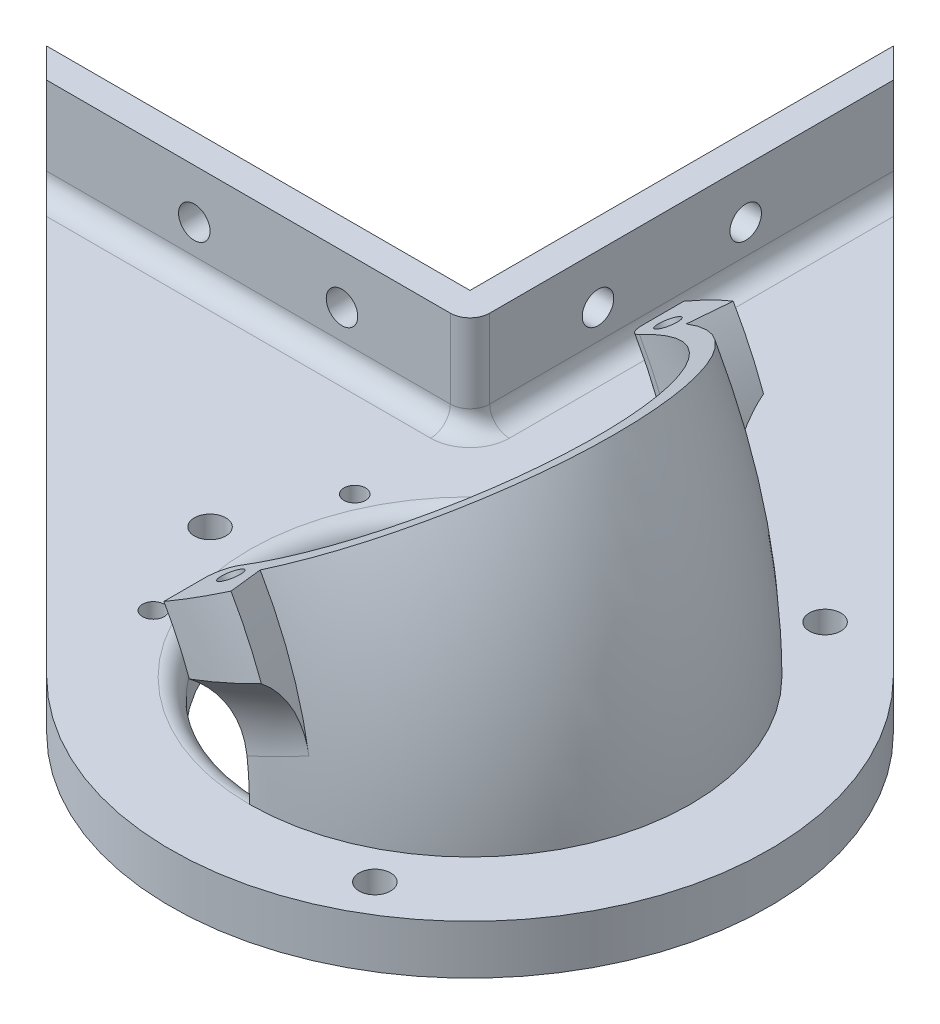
ISO-10303-21;
HEADER;
FILE_DESCRIPTION(('STEP AP214'),'2;1');
FILE_NAME('part.step','',(''),(''),'','','');
FILE_SCHEMA(('AUTOMOTIVE_DESIGN { 1 0 10303 214 1 1 1 1 }'));
ENDSEC;
DATA;
#1=APPLICATION_CONTEXT('core data for automotive mechanical design processes');
#2=APPLICATION_PROTOCOL_DEFINITION('international standard','automotive_design',2000,#1);
#3=PRODUCT_CONTEXT('',#1,'mechanical');
#4=PRODUCT('Part','Part','',(#3));
#5=PRODUCT_RELATED_PRODUCT_CATEGORY('part','',(#4));
#6=PRODUCT_DEFINITION_FORMATION('','',#4);
#7=PRODUCT_DEFINITION_CONTEXT('part definition',#1,'design');
#8=PRODUCT_DEFINITION('design','',#6,#7);
#9=PRODUCT_DEFINITION_SHAPE('','',#8);
#10=(LENGTH_UNIT() NAMED_UNIT(*) SI_UNIT(.MILLI.,.METRE.));
#11=(NAMED_UNIT(*) PLANE_ANGLE_UNIT() SI_UNIT($,.RADIAN.));
#12=(NAMED_UNIT(*) SI_UNIT($,.STERADIAN.) SOLID_ANGLE_UNIT());
#13=UNCERTAINTY_MEASURE_WITH_UNIT(LENGTH_MEASURE(1.E-05),#10,'distance_accuracy_value','');
#14=(GEOMETRIC_REPRESENTATION_CONTEXT(3) GLOBAL_UNCERTAINTY_ASSIGNED_CONTEXT((#13)) GLOBAL_UNIT_ASSIGNED_CONTEXT((#10,
#11,#12)) REPRESENTATION_CONTEXT('',''));
#15=CARTESIAN_POINT('',(0.,0.,0.));
#16=DIRECTION('',(0.,0.,1.));
#17=DIRECTION('',(1.,0.,0.));
#18=AXIS2_PLACEMENT_3D('',#15,#16,#17);
#19=CARTESIAN_POINT('',(0.,0.,0.));
#20=DIRECTION('',(0.,1.,0.));
#21=DIRECTION('',(0.,0.,1.));
#22=AXIS2_PLACEMENT_3D('',#19,#20,#21);
#23=PLANE('',#22);
#24=CARTESIAN_POINT('',(-21.9326484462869,0.,-10.2273619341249));
#25=DIRECTION('',(0.,1.,0.));
#26=DIRECTION('',(0.,0.,1.));
#27=AXIS2_PLACEMENT_3D('',#24,#25,#26);
#28=CIRCLE('',#27,1.1);
#29=CARTESIAN_POINT('',(-21.9326484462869,0.,-9.12736193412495));
#30=VERTEX_POINT('',#29);
#31=EDGE_CURVE('E311',#30,#30,#28,.T.);
#32=ORIENTED_EDGE('',*,*,#31,.F.);
#33=EDGE_LOOP('',(#32));
#34=FACE_BOUND('',#33,.T.);
#35=CARTESIAN_POINT('',(-21.9326484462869,0.,10.2273619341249));
#36=DIRECTION('',(0.,1.,0.));
#37=DIRECTION('',(0.,0.,-1.));
#38=AXIS2_PLACEMENT_3D('',#35,#36,#37);
#39=CIRCLE('',#38,1.1);
#40=CARTESIAN_POINT('',(-21.9326484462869,0.,9.12736193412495));
#41=VERTEX_POINT('',#40);
#42=EDGE_CURVE('E315',#41,#41,#39,.T.);
#43=ORIENTED_EDGE('',*,*,#42,.F.);
#44=EDGE_LOOP('',(#43));
#45=FACE_BOUND('',#44,.T.);
#46=CARTESIAN_POINT('',(0.,0.,0.));
#47=DIRECTION('',(0.,1.,0.));
#48=DIRECTION('',(0.,0.,1.));
#49=AXIS2_PLACEMENT_3D('',#46,#47,#48);
#50=CIRCLE('',#49,22.4);
#51=CARTESIAN_POINT('',(0.,0.,22.4));
#52=VERTEX_POINT('',#51);
#53=CARTESIAN_POINT('',(0.,0.,-22.4));
#54=VERTEX_POINT('',#53);
#55=EDGE_CURVE('E364',#52,#54,#50,.T.);
#56=ORIENTED_EDGE('',*,*,#55,.F.);
#57=CARTESIAN_POINT('',(0.,0.,0.));
#58=DIRECTION('',(0.,1.,0.));
#59=DIRECTION('',(0.,0.,1.));
#60=AXIS2_PLACEMENT_3D('',#57,#58,#59);
#61=CIRCLE('',#60,22.4);
#62=EDGE_CURVE('E774',#52,#54,#61,.F.);
#63=ORIENTED_EDGE('',*,*,#62,.T.);
#64=EDGE_LOOP('',(#56,#63));
#65=FACE_BOUND('',#64,.T.);
#66=CARTESIAN_POINT('',(13.1999999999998,0.,22.8630706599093));
#67=DIRECTION('',(0.,1.,0.));
#68=DIRECTION('',(0.,0.,1.));
#69=AXIS2_PLACEMENT_3D('',#66,#67,#68);
#70=CIRCLE('',#69,1.6);
#71=CARTESIAN_POINT('',(13.1999999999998,0.,24.4630706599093));
#72=VERTEX_POINT('',#71);
#73=EDGE_CURVE('E437',#72,#72,#70,.T.);
#74=ORIENTED_EDGE('',*,*,#73,.F.);
#75=EDGE_LOOP('',(#74));
#76=FACE_BOUND('',#75,.T.);
#77=CARTESIAN_POINT('',(13.2000000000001,0.,-22.8630706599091));
#78=DIRECTION('',(0.,1.,0.));
#79=DIRECTION('',(0.,0.,1.));
#80=AXIS2_PLACEMENT_3D('',#77,#78,#79);
#81=CIRCLE('',#80,1.6);
#82=CARTESIAN_POINT('',(13.2000000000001,0.,-21.2630706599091));
#83=VERTEX_POINT('',#82);
#84=EDGE_CURVE('E441',#83,#83,#81,.T.);
#85=ORIENTED_EDGE('',*,*,#84,.F.);
#86=EDGE_LOOP('',(#85));
#87=FACE_BOUND('',#86,.T.);
#88=CARTESIAN_POINT('',(-26.4,0.,0.));
#89=DIRECTION('',(0.,1.,0.));
#90=DIRECTION('',(0.,0.,1.));
#91=AXIS2_PLACEMENT_3D('',#88,#89,#90);
#92=CIRCLE('',#91,1.6);
#93=CARTESIAN_POINT('',(-26.4,0.,1.6));
#94=VERTEX_POINT('',#93);
#95=EDGE_CURVE('E445',#94,#94,#92,.T.);
#96=ORIENTED_EDGE('',*,*,#95,.F.);
#97=EDGE_LOOP('',(#96));
#98=FACE_BOUND('',#97,.T.);
#99=CARTESIAN_POINT('',(-22.9999999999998,0.,-23.));
#100=DIRECTION('',(0.,1.,0.));
#101=DIRECTION('',(0.,0.,1.));
#102=AXIS2_PLACEMENT_3D('',#99,#100,#101);
#103=CIRCLE('',#102,4.);
#104=CARTESIAN_POINT('',(-22.9999999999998,0.,-19.));
#105=VERTEX_POINT('',#104);
#106=CARTESIAN_POINT('',(-18.9999999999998,0.,-23.));
#107=VERTEX_POINT('',#106);
#108=EDGE_CURVE('E620',#105,#107,#103,.T.);
#109=ORIENTED_EDGE('',*,*,#108,.F.);
#110=DIRECTION('',(1.,0.,0.));
#111=VECTOR('',#110,1.);
#112=CARTESIAN_POINT('',(0.,0.,-19.));
#113=LINE('',#112,#111);
#114=CARTESIAN_POINT('',(-61.9920922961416,0.,-19.));
#115=VERTEX_POINT('',#114);
#116=EDGE_CURVE('E622',#105,#115,#113,.F.);
#117=ORIENTED_EDGE('',*,*,#116,.T.);
#118=DIRECTION('',(-0.707106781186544,0.,-0.707106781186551));
#119=VECTOR('',#118,1.);
#120=CARTESIAN_POINT('',(-21.4960461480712,0.,21.4960461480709));
#121=LINE('',#120,#119);
#122=CARTESIAN_POINT('',(-21.4960461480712,0.,21.4960461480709));
#123=VERTEX_POINT('',#122);
#124=EDGE_CURVE('E287',#123,#115,#121,.T.);
#125=ORIENTED_EDGE('',*,*,#124,.F.);
#126=CARTESIAN_POINT('',(0.,0.,0.));
#127=DIRECTION('',(0.,1.,0.));
#128=DIRECTION('',(0.,0.,1.));
#129=AXIS2_PLACEMENT_3D('',#126,#127,#128);
#130=CIRCLE('',#129,30.4);
#131=CARTESIAN_POINT('',(21.496046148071,0.,-21.4960461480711));
#132=VERTEX_POINT('',#131);
#133=EDGE_CURVE('E417',#123,#132,#130,.T.);
#134=ORIENTED_EDGE('',*,*,#133,.T.);
#135=DIRECTION('',(0.707106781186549,0.,0.707106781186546));
#136=VECTOR('',#135,1.);
#137=CARTESIAN_POINT('',(21.496046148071,0.,-21.4960461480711));
#138=LINE('',#137,#136);
#139=CARTESIAN_POINT('',(-18.9999999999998,0.,-61.9920922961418));
#140=VERTEX_POINT('',#139);
#141=EDGE_CURVE('E273',#140,#132,#138,.T.);
#142=ORIENTED_EDGE('',*,*,#141,.F.);
#143=DIRECTION('',(0.,0.,-1.));
#144=VECTOR('',#143,1.);
#145=CARTESIAN_POINT('',(-18.9999999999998,0.,0.));
#146=LINE('',#145,#144);
#147=EDGE_CURVE('E625',#140,#107,#146,.F.);
#148=ORIENTED_EDGE('',*,*,#147,.T.);
#149=EDGE_LOOP('',(#109,#117,#125,#134,#142,#148));
#150=FACE_BOUND('',#149,.T.);
#151=ADVANCED_FACE('F49',(#34,#45,#65,#76,#87,#98,#150),#23,.T.);
#152=CARTESIAN_POINT('',(-26.4,-5.,0.));
#153=DIRECTION('',(0.,1.,0.));
#154=DIRECTION('',(0.,0.,1.));
#155=AXIS2_PLACEMENT_3D('',#152,#153,#154);
#156=CYLINDRICAL_SURFACE('',#155,1.6);
#157=CARTESIAN_POINT('',(-26.4,-5.,0.));
#158=DIRECTION('',(0.,1.,0.));
#159=DIRECTION('',(0.,0.,1.));
#160=AXIS2_PLACEMENT_3D('',#157,#158,#159);
#161=CIRCLE('',#160,1.6);
#162=CARTESIAN_POINT('',(-26.4,-5.,1.6));
#163=VERTEX_POINT('',#162);
#164=EDGE_CURVE('E425',#163,#163,#161,.T.);
#165=ORIENTED_EDGE('',*,*,#164,.F.);
#166=EDGE_LOOP('',(#165));
#167=FACE_BOUND('',#166,.T.);
#168=ORIENTED_EDGE('',*,*,#95,.T.);
#169=EDGE_LOOP('',(#168));
#170=FACE_BOUND('',#169,.T.);
#171=ADVANCED_FACE('F581',(#167,#170),#156,.F.);
#172=CARTESIAN_POINT('',(13.2000000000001,-5.,-22.8630706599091));
#173=DIRECTION('',(0.,1.,0.));
#174=DIRECTION('',(0.,0.,1.));
#175=AXIS2_PLACEMENT_3D('',#172,#173,#174);
#176=CYLINDRICAL_SURFACE('',#175,1.6);
#177=CARTESIAN_POINT('',(13.2000000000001,-5.,-22.8630706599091));
#178=DIRECTION('',(0.,1.,0.));
#179=DIRECTION('',(0.,0.,1.));
#180=AXIS2_PLACEMENT_3D('',#177,#178,#179);
#181=CIRCLE('',#180,1.6);
#182=CARTESIAN_POINT('',(13.2000000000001,-5.,-21.2630706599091));
#183=VERTEX_POINT('',#182);
#184=EDGE_CURVE('E421',#183,#183,#181,.T.);
#185=ORIENTED_EDGE('',*,*,#184,.F.);
#186=EDGE_LOOP('',(#185));
#187=FACE_BOUND('',#186,.T.);
#188=ORIENTED_EDGE('',*,*,#84,.T.);
#189=EDGE_LOOP('',(#188));
#190=FACE_BOUND('',#189,.T.);
#191=ADVANCED_FACE('F589',(#187,#190),#176,.F.);
#192=CARTESIAN_POINT('',(13.1999999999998,-5.,22.8630706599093));
#193=DIRECTION('',(0.,1.,0.));
#194=DIRECTION('',(0.,0.,1.));
#195=AXIS2_PLACEMENT_3D('',#192,#193,#194);
#196=CYLINDRICAL_SURFACE('',#195,1.6);
#197=CARTESIAN_POINT('',(13.1999999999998,-5.,22.8630706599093));
#198=DIRECTION('',(0.,1.,0.));
#199=DIRECTION('',(0.,0.,1.));
#200=AXIS2_PLACEMENT_3D('',#197,#198,#199);
#201=CIRCLE('',#200,1.6);
#202=CARTESIAN_POINT('',(13.1999999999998,-5.,24.4630706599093));
#203=VERTEX_POINT('',#202);
#204=EDGE_CURVE('E416',#203,#203,#201,.T.);
#205=ORIENTED_EDGE('',*,*,#204,.F.);
#206=EDGE_LOOP('',(#205));
#207=FACE_BOUND('',#206,.T.);
#208=ORIENTED_EDGE('',*,*,#73,.T.);
#209=EDGE_LOOP('',(#208));
#210=FACE_BOUND('',#209,.T.);
#211=ADVANCED_FACE('F601',(#207,#210),#196,.F.);
#212=CARTESIAN_POINT('',(0.,-5.,0.));
#213=DIRECTION('',(0.,1.,0.));
#214=DIRECTION('',(0.,0.,1.));
#215=AXIS2_PLACEMENT_3D('',#212,#213,#214);
#216=CYLINDRICAL_SURFACE('',#215,20.4);
#217=CARTESIAN_POINT('',(0.,-5.,0.));
#218=DIRECTION('',(0.,1.,0.));
#219=DIRECTION('',(0.,0.,1.));
#220=AXIS2_PLACEMENT_3D('',#217,#218,#219);
#221=CIRCLE('',#220,20.4);
#222=CARTESIAN_POINT('',(0.,-5.,20.4));
#223=VERTEX_POINT('',#222);
#224=EDGE_CURVE('E412',#223,#223,#221,.T.);
#225=ORIENTED_EDGE('',*,*,#224,.F.);
#226=EDGE_LOOP('',(#225));
#227=FACE_BOUND('',#226,.T.);
#228=CARTESIAN_POINT('',(0.,-2.,0.));
#229=DIRECTION('',(0.,1.,0.));
#230=DIRECTION('',(0.,0.,1.));
#231=AXIS2_PLACEMENT_3D('',#228,#229,#230);
#232=CIRCLE('',#231,20.4);
#233=CARTESIAN_POINT('',(1.77216476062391,-2.,-20.3228795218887));
#234=VERTEX_POINT('',#233);
#235=CARTESIAN_POINT('',(1.77216476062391,-2.,20.3228795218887));
#236=VERTEX_POINT('',#235);
#237=EDGE_CURVE('E783',#234,#236,#232,.T.);
#238=ORIENTED_EDGE('',*,*,#237,.T.);
#239=CARTESIAN_POINT('',(0.240561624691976,11.2,20.3985815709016));
#240=CARTESIAN_POINT('',(-1.64416096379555,10.6013231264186,20.4208082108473));
#241=CARTESIAN_POINT('',(-1.6420239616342,10.5945945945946,22.3984425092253));
#242=CARTESIAN_POINT('',(0.372802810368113,10.7428212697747,20.3970033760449));
#243=CARTESIAN_POINT('',(-1.50819187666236,10.173613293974,20.4313781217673));
#244=CARTESIAN_POINT('',(-1.50466692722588,10.1621282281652,22.3967095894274));
#245=CARTESIAN_POINT('',(0.496936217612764,10.282827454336,20.3942714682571));
#246=CARTESIAN_POINT('',(-1.37979842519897,9.74103858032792,20.439997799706));
#247=CARTESIAN_POINT('',(-1.37573132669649,9.72699894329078,22.3937098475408));
#248=CARTESIAN_POINT('',(0.728821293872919,9.35790314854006,20.3873116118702));
#249=CARTESIAN_POINT('',(-1.13968714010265,8.87027904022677,20.4540968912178));
#250=CARTESIAN_POINT('',(-1.13487560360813,8.85207054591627,22.3860676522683));
#251=CARTESIAN_POINT('',(0.836573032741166,8.89297267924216,20.3830836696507));
#252=CARTESIAN_POINT('',(-1.02779608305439,8.43182297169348,20.4595981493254));
#253=CARTESIAN_POINT('',(-1.02295540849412,8.41227145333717,22.3814252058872));
#254=CARTESIAN_POINT('',(1.03552803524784,7.95887256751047,20.3739431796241));
#255=CARTESIAN_POINT('',(-0.821057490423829,7.55013075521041,20.4683015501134));
#256=CARTESIAN_POINT('',(-0.816303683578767,7.52866323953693,22.3713885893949));
#257=CARTESIAN_POINT('',(1.12673157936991,7.48970299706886,20.3690306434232));
#258=CARTESIAN_POINT('',(-0.726055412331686,7.10659734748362,20.471517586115));
#259=CARTESIAN_POINT('',(-0.721571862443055,7.08485418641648,22.3659944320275));
#260=CARTESIAN_POINT('',(1.29245566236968,6.54785355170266,20.3591847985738));
#261=CARTESIAN_POINT('',(-0.553355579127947,6.21565681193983,20.4763588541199));
#262=CARTESIAN_POINT('',(-0.549436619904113,6.1939155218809,22.355183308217));
#263=CARTESIAN_POINT('',(1.36697626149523,6.07517368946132,20.3542514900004));
#264=CARTESIAN_POINT('',(-0.475525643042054,5.76793063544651,20.4779920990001));
#265=CARTESIAN_POINT('',(-0.472033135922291,5.74678592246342,22.3497663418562));
#266=CARTESIAN_POINT('',(1.56227534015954,4.67483639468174,20.3405134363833));
#267=CARTESIAN_POINT('',(-0.271869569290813,4.44294208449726,20.4813790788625));
#268=CARTESIAN_POINT('',(-0.269178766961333,4.42214253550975,22.3346814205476));
#269=CARTESIAN_POINT('',(1.65941964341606,3.74305279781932,20.332501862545));
#270=CARTESIAN_POINT('',(-0.169847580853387,3.55737789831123,20.4817939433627));
#271=CARTESIAN_POINT('',(-0.1682763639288,3.5407256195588,22.3258843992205));
#272=CARTESIAN_POINT('',(1.78899457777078,1.87417928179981,20.3215070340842));
#273=CARTESIAN_POINT('',(-0.0341225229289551,1.78254503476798,20.4820048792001));
#274=CARTESIAN_POINT('',(-0.0336887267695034,1.77287229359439,22.3138116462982));
#275=CARTESIAN_POINT('',(1.82142857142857,0.937089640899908,20.3185235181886));
#276=CARTESIAN_POINT('',(0.,0.890585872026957,20.4818031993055));
#277=CARTESIAN_POINT('',(0.,0.886436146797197,22.3105356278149));
#278=CARTESIAN_POINT('',(1.82142857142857,-0.937089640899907,20.3185235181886));
#279=CARTESIAN_POINT('',(0.,-0.890585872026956,20.4818031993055));
#280=CARTESIAN_POINT('',(0.,-0.886436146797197,22.3105356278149));
#281=CARTESIAN_POINT('',(1.78899457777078,-1.87417928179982,20.3215070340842));
#282=CARTESIAN_POINT('',(-0.0341225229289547,-1.78254503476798,20.4820048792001));
#283=CARTESIAN_POINT('',(-0.0336887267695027,-1.77287229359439,22.3138116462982));
#284=CARTESIAN_POINT('',(1.65941964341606,-3.74305279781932,20.332501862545));
#285=CARTESIAN_POINT('',(-0.169847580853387,-3.55737789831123,20.4817939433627));
#286=CARTESIAN_POINT('',(-0.1682763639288,-3.5407256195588,22.3258843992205));
#287=CARTESIAN_POINT('',(1.56227534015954,-4.67483639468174,20.3405134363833));
#288=CARTESIAN_POINT('',(-0.271869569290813,-4.44294208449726,20.4813790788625));
#289=CARTESIAN_POINT('',(-0.269178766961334,-4.42214253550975,22.3346814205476));
#290=CARTESIAN_POINT('',(1.36697626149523,-6.07517368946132,20.3542514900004));
#291=CARTESIAN_POINT('',(-0.475525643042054,-5.76793063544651,20.4779920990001));
#292=CARTESIAN_POINT('',(-0.47203313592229,-5.74678592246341,22.3497663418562));
#293=CARTESIAN_POINT('',(1.29245566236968,-6.54785355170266,20.3591847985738));
#294=CARTESIAN_POINT('',(-0.553355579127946,-6.21565681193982,20.4763588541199));
#295=CARTESIAN_POINT('',(-0.54943661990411,-6.19391552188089,22.355183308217));
#296=CARTESIAN_POINT('',(1.12673157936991,-7.48970299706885,20.3690306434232));
#297=CARTESIAN_POINT('',(-0.726055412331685,-7.10659734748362,20.471517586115));
#298=CARTESIAN_POINT('',(-0.721571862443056,-7.08485418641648,22.3659944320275));
#299=CARTESIAN_POINT('',(1.03552803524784,-7.95887256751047,20.3739431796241));
#300=CARTESIAN_POINT('',(-0.821057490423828,-7.55013075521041,20.4683015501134));
#301=CARTESIAN_POINT('',(-0.816303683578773,-7.52866323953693,22.3713885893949));
#302=CARTESIAN_POINT('',(0.836573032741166,-8.89297267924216,20.3830836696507));
#303=CARTESIAN_POINT('',(-1.02779608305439,-8.43182297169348,20.4595981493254));
#304=CARTESIAN_POINT('',(-1.02295540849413,-8.41227145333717,22.3814252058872));
#305=CARTESIAN_POINT('',(0.728821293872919,-9.35790314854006,20.3873116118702));
#306=CARTESIAN_POINT('',(-1.13968714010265,-8.87027904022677,20.4540968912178));
#307=CARTESIAN_POINT('',(-1.13487560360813,-8.85207054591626,22.3860676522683));
#308=CARTESIAN_POINT('',(0.496936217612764,-10.282827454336,20.3942714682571));
#309=CARTESIAN_POINT('',(-1.37979842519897,-9.74103858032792,20.439997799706));
#310=CARTESIAN_POINT('',(-1.37573132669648,-9.72699894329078,22.3937098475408));
#311=CARTESIAN_POINT('',(0.372802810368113,-10.7428212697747,20.3970033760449));
#312=CARTESIAN_POINT('',(-1.50819187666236,-10.173613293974,20.4313781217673));
#313=CARTESIAN_POINT('',(-1.50466692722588,-10.1621282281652,22.3967095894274));
#314=CARTESIAN_POINT('',(0.240561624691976,-11.2,20.3985815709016));
#315=CARTESIAN_POINT('',(-1.64416096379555,-10.6013231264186,20.4208082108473));
#316=CARTESIAN_POINT('',(-1.6420239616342,-10.5945945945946,22.3984425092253));
#317=(BOUNDED_SURFACE() B_SPLINE_SURFACE(3,2,((#239,#240,#241),(#242,#243,#244),(#245,#246,
#247),(#248,#249,#250),(#251,#252,#253),(#254,#255,#256),(#257,#258,#259),(#260,#261,#262),
(#263,#264,#265),(#266,#267,#268),(#269,#270,#271),(#272,#273,#274),(#275,#276,#277),(#278,#279,
#280),(#281,#282,#283),(#284,#285,#286),(#287,#288,#289),(#290,#291,#292),(#293,#294,#295),
(#296,#297,#298),(#299,#300,#301),(#302,#303,#304),(#305,#306,#307),(#308,#309,#310),(#311,#312,
#313),(#314,#315,#316)),.UNSPECIFIED.,.F.,.F.,.F.) B_SPLINE_SURFACE_WITH_KNOTS((4,2,2,2,2,2,2,2,
2,2,2,2,4),(3,3),(0.,1.43895824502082,2.8779103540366,4.31683807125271,5.75576059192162,
8.56654184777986,11.3771770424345,14.1878122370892,16.9985934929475,18.4375160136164,
19.8764437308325,21.3153958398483,22.7543540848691),(0.,1.),
.UNSPECIFIED.) GEOMETRIC_REPRESENTATION_ITEM() RATIONAL_B_SPLINE_SURFACE(((1.,0.71106926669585,
1.),(1.,0.713258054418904,1.),(1.,0.715328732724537,1.),(1.,0.719220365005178,1.),(1.,
0.721041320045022,1.),(1.,0.724419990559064,1.),(1.,0.725977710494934,1.),(1.,0.728819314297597,
1.),(1.,0.730103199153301,1.),(1.,0.733477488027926,1.),(1.,0.735169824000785,1.),(1.,
0.737430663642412,1.),(1.,0.737999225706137,1.),(1.,0.737999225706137,1.),(1.,0.737430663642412,
1.),(1.,0.735169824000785,1.),(1.,0.733477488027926,1.),(1.,0.730103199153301,1.),(1.,
0.728819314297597,1.),(1.,0.725977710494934,1.),(1.,0.724419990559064,1.),(1.,0.721041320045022,
1.),(1.,0.719220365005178,1.),(1.,0.715328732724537,1.),(1.,0.713258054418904,1.),(1.,
0.71106926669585,1.))) REPRESENTATION_ITEM('') SURFACE());
#318=CARTESIAN_POINT('',(0.240561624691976,-11.2,20.3985815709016));
#319=CARTESIAN_POINT('',(0.372802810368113,-10.7428212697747,20.3970033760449));
#320=CARTESIAN_POINT('',(0.496936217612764,-10.282827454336,20.3942714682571));
#321=CARTESIAN_POINT('',(0.728821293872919,-9.35790314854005,20.3873116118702));
#322=CARTESIAN_POINT('',(0.836573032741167,-8.89297267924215,20.3830836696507));
#323=CARTESIAN_POINT('',(1.03552803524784,-7.95887256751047,20.3739431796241));
#324=CARTESIAN_POINT('',(1.12673157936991,-7.48970299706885,20.3690306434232));
#325=CARTESIAN_POINT('',(1.29245566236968,-6.54785355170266,20.3591847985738));
#326=CARTESIAN_POINT('',(1.36697626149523,-6.07517368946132,20.3542514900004));
#327=CARTESIAN_POINT('',(1.56227534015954,-4.67483639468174,20.3405134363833));
#328=CARTESIAN_POINT('',(1.65941964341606,-3.74305279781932,20.332501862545));
#329=CARTESIAN_POINT('',(1.78899457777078,-1.87417928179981,20.3215070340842));
#330=CARTESIAN_POINT('',(1.82142857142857,-0.937089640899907,20.3185235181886));
#331=CARTESIAN_POINT('',(1.82142857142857,0.937089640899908,20.3185235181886));
#332=CARTESIAN_POINT('',(1.78899457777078,1.87417928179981,20.3215070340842));
#333=CARTESIAN_POINT('',(1.65941964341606,3.74305279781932,20.332501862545));
#334=CARTESIAN_POINT('',(1.56227534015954,4.67483639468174,20.3405134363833));
#335=CARTESIAN_POINT('',(1.36697626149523,6.07517368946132,20.3542514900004));
#336=CARTESIAN_POINT('',(1.29245566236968,6.54785355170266,20.3591847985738));
#337=CARTESIAN_POINT('',(1.12673157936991,7.48970299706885,20.3690306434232));
#338=CARTESIAN_POINT('',(1.03552803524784,7.95887256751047,20.3739431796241));
#339=CARTESIAN_POINT('',(0.836573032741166,8.89297267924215,20.3830836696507));
#340=CARTESIAN_POINT('',(0.728821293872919,9.35790314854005,20.3873116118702));
#341=CARTESIAN_POINT('',(0.496936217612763,10.282827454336,20.3942714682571));
#342=CARTESIAN_POINT('',(0.372802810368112,10.7428212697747,20.3970033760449));
#343=CARTESIAN_POINT('',(0.240561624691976,11.2,20.3985815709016));
#344=B_SPLINE_CURVE_WITH_KNOTS('',3,(#318,#319,#320,#321,#322,#323,#324,#325,#326,#327,#328,
#329,#330,#331,#332,#333,#334,#335,#336,#337,#338,#339,#340,#341,#342,#343),.UNSPECIFIED.,.F.,
.F.,(4,2,2,2,2,2,2,2,2,2,2,2,4),(0.,1.43895824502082,2.8779103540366,4.31683807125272,
5.75576059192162,8.56654184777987,11.3771770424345,14.1878122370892,16.9985934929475,
18.4375160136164,19.8764437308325,21.3153958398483,22.7543540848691),.UNSPECIFIED.);
#345=CARTESIAN_POINT('',(1.8214285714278,0.,20.3185235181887));
#346=VERTEX_POINT('',#345);
#347=EDGE_CURVE('E777',#236,#346,#344,.T.);
#348=ORIENTED_EDGE('',*,*,#347,.T.);
#349=CARTESIAN_POINT('',(0.,0.,0.));
#350=DIRECTION('',(0.,1.,0.));
#351=DIRECTION('',(0.,0.,1.));
#352=AXIS2_PLACEMENT_3D('',#349,#350,#351);
#353=CIRCLE('',#352,20.4);
#354=CARTESIAN_POINT('',(1.82142857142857,0.,-20.3185235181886));
#355=VERTEX_POINT('',#354);
#356=EDGE_CURVE('E411',#346,#355,#353,.T.);
#357=ORIENTED_EDGE('',*,*,#356,.T.);
#358=CARTESIAN_POINT('',(-1.64202396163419,10.5945945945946,-22.3984425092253));
#359=CARTESIAN_POINT('',(-1.64416096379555,10.6013231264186,-20.4208082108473));
#360=CARTESIAN_POINT('',(0.240561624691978,11.2,-20.3985815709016));
#361=CARTESIAN_POINT('',(-1.50466692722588,10.1621282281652,-22.3967095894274));
#362=CARTESIAN_POINT('',(-1.50819187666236,10.173613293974,-20.4313781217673));
#363=CARTESIAN_POINT('',(0.372802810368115,10.7428212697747,-20.3970033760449));
#364=CARTESIAN_POINT('',(-1.37573132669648,9.72699894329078,-22.3937098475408));
#365=CARTESIAN_POINT('',(-1.37979842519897,9.74103858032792,-20.439997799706));
#366=CARTESIAN_POINT('',(0.496936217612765,10.282827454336,-20.3942714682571));
#367=CARTESIAN_POINT('',(-1.13487560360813,8.85207054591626,-22.3860676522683));
#368=CARTESIAN_POINT('',(-1.13968714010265,8.87027904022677,-20.4540968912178));
#369=CARTESIAN_POINT('',(0.72882129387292,9.35790314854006,-20.3873116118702));
#370=CARTESIAN_POINT('',(-1.02295540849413,8.41227145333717,-22.3814252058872));
#371=CARTESIAN_POINT('',(-1.02779608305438,8.43182297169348,-20.4595981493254));
#372=CARTESIAN_POINT('',(0.836573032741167,8.89297267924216,-20.3830836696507));
#373=CARTESIAN_POINT('',(-0.816303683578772,7.52866323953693,-22.3713885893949));
#374=CARTESIAN_POINT('',(-0.821057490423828,7.55013075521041,-20.4683015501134));
#375=CARTESIAN_POINT('',(1.03552803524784,7.95887256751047,-20.3739431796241));
#376=CARTESIAN_POINT('',(-0.721571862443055,7.08485418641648,-22.3659944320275));
#377=CARTESIAN_POINT('',(-0.726055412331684,7.10659734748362,-20.471517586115));
#378=CARTESIAN_POINT('',(1.12673157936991,7.48970299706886,-20.3690306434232));
#379=CARTESIAN_POINT('',(-0.549436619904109,6.1939155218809,-22.355183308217));
#380=CARTESIAN_POINT('',(-0.553355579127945,6.21565681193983,-20.4763588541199));
#381=CARTESIAN_POINT('',(1.29245566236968,6.54785355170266,-20.3591847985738));
#382=CARTESIAN_POINT('',(-0.472033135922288,5.74678592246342,-22.3497663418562));
#383=CARTESIAN_POINT('',(-0.475525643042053,5.76793063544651,-20.4779920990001));
#384=CARTESIAN_POINT('',(1.36697626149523,6.07517368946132,-20.3542514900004));
#385=CARTESIAN_POINT('',(-0.269178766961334,4.42214253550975,-22.3346814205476));
#386=CARTESIAN_POINT('',(-0.271869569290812,4.44294208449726,-20.4813790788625));
#387=CARTESIAN_POINT('',(1.56227534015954,4.67483639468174,-20.3405134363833));
#388=CARTESIAN_POINT('',(-0.168276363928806,3.5407256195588,-22.3258843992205));
#389=CARTESIAN_POINT('',(-0.169847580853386,3.55737789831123,-20.4817939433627));
#390=CARTESIAN_POINT('',(1.65941964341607,3.74305279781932,-20.332501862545));
#391=CARTESIAN_POINT('',(-0.0336887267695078,1.77287229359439,-22.3138116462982));
#392=CARTESIAN_POINT('',(-0.0341225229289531,1.78254503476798,-20.4820048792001));
#393=CARTESIAN_POINT('',(1.78899457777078,1.87417928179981,-20.3215070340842));
#394=CARTESIAN_POINT('',(0.,0.886436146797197,-22.3105356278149));
#395=CARTESIAN_POINT('',(0.,0.890585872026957,-20.4818031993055));
#396=CARTESIAN_POINT('',(1.82142857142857,0.937089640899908,-20.3185235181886));
#397=CARTESIAN_POINT('',(0.,-0.886436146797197,-22.3105356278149));
#398=CARTESIAN_POINT('',(0.,-0.890585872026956,-20.4818031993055));
#399=CARTESIAN_POINT('',(1.82142857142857,-0.937089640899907,-20.3185235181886));
#400=CARTESIAN_POINT('',(-0.0336887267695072,-1.77287229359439,-22.3138116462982));
#401=CARTESIAN_POINT('',(-0.0341225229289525,-1.78254503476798,-20.4820048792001));
#402=CARTESIAN_POINT('',(1.78899457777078,-1.87417928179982,-20.3215070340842));
#403=CARTESIAN_POINT('',(-0.168276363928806,-3.5407256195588,-22.3258843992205));
#404=CARTESIAN_POINT('',(-0.169847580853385,-3.55737789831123,-20.4817939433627));
#405=CARTESIAN_POINT('',(1.65941964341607,-3.74305279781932,-20.332501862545));
#406=CARTESIAN_POINT('',(-0.269178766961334,-4.42214253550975,-22.3346814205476));
#407=CARTESIAN_POINT('',(-0.271869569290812,-4.44294208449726,-20.4813790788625));
#408=CARTESIAN_POINT('',(1.56227534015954,-4.67483639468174,-20.3405134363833));
#409=CARTESIAN_POINT('',(-0.472033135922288,-5.74678592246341,-22.3497663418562));
#410=CARTESIAN_POINT('',(-0.475525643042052,-5.76793063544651,-20.4779920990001));
#411=CARTESIAN_POINT('',(1.36697626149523,-6.07517368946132,-20.3542514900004));
#412=CARTESIAN_POINT('',(-0.549436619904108,-6.19391552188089,-22.355183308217));
#413=CARTESIAN_POINT('',(-0.553355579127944,-6.21565681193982,-20.4763588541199));
#414=CARTESIAN_POINT('',(1.29245566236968,-6.54785355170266,-20.3591847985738));
#415=CARTESIAN_POINT('',(-0.721571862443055,-7.08485418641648,-22.3659944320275));
#416=CARTESIAN_POINT('',(-0.726055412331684,-7.10659734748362,-20.471517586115));
#417=CARTESIAN_POINT('',(1.12673157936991,-7.48970299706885,-20.3690306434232));
#418=CARTESIAN_POINT('',(-0.816303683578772,-7.52866323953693,-22.3713885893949));
#419=CARTESIAN_POINT('',(-0.821057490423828,-7.55013075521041,-20.4683015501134));
#420=CARTESIAN_POINT('',(1.03552803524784,-7.95887256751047,-20.3739431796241));
#421=CARTESIAN_POINT('',(-1.02295540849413,-8.41227145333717,-22.3814252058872));
#422=CARTESIAN_POINT('',(-1.02779608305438,-8.43182297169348,-20.4595981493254));
#423=CARTESIAN_POINT('',(0.836573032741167,-8.89297267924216,-20.3830836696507));
#424=CARTESIAN_POINT('',(-1.13487560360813,-8.85207054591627,-22.3860676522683));
#425=CARTESIAN_POINT('',(-1.13968714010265,-8.87027904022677,-20.4540968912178));
#426=CARTESIAN_POINT('',(0.72882129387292,-9.35790314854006,-20.3873116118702));
#427=CARTESIAN_POINT('',(-1.37573132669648,-9.72699894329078,-22.3937098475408));
#428=CARTESIAN_POINT('',(-1.37979842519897,-9.74103858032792,-20.439997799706));
#429=CARTESIAN_POINT('',(0.496936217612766,-10.282827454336,-20.3942714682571));
#430=CARTESIAN_POINT('',(-1.50466692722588,-10.1621282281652,-22.3967095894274));
#431=CARTESIAN_POINT('',(-1.50819187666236,-10.173613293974,-20.4313781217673));
#432=CARTESIAN_POINT('',(0.372802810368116,-10.7428212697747,-20.3970033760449));
#433=CARTESIAN_POINT('',(-1.64202396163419,-10.5945945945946,-22.3984425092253));
#434=CARTESIAN_POINT('',(-1.64416096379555,-10.6013231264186,-20.4208082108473));
#435=CARTESIAN_POINT('',(0.240561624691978,-11.2,-20.3985815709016));
#436=(BOUNDED_SURFACE() B_SPLINE_SURFACE(3,2,((#358,#359,#360),(#361,#362,#363),(#364,#365,
#366),(#367,#368,#369),(#370,#371,#372),(#373,#374,#375),(#376,#377,#378),(#379,#380,#381),
(#382,#383,#384),(#385,#386,#387),(#388,#389,#390),(#391,#392,#393),(#394,#395,#396),(#397,#398,
#399),(#400,#401,#402),(#403,#404,#405),(#406,#407,#408),(#409,#410,#411),(#412,#413,#414),
(#415,#416,#417),(#418,#419,#420),(#421,#422,#423),(#424,#425,#426),(#427,#428,#429),(#430,#431,
#432),(#433,#434,#435)),.UNSPECIFIED.,.F.,.F.,.F.) B_SPLINE_SURFACE_WITH_KNOTS((4,2,2,2,2,2,2,2,
2,2,2,2,4),(3,3),(0.,1.43895824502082,2.8779103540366,4.31683807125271,5.75576059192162,
8.56654184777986,11.3771770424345,14.1878122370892,16.9985934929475,18.4375160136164,
19.8764437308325,21.3153958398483,22.7543540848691),(0.,1.),
.UNSPECIFIED.) GEOMETRIC_REPRESENTATION_ITEM() RATIONAL_B_SPLINE_SURFACE(((1.,0.71106926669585,
1.),(1.,0.713258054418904,1.),(1.,0.715328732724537,1.),(1.,0.719220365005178,1.),(1.,
0.721041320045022,1.),(1.,0.724419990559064,1.),(1.,0.725977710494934,1.),(1.,0.728819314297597,
1.),(1.,0.730103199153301,1.),(1.,0.733477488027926,1.),(1.,0.735169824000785,1.),(1.,
0.737430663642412,1.),(1.,0.737999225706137,1.),(1.,0.737999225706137,1.),(1.,0.737430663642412,
1.),(1.,0.735169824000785,1.),(1.,0.733477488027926,1.),(1.,0.730103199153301,1.),(1.,
0.728819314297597,1.),(1.,0.725977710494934,1.),(1.,0.724419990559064,1.),(1.,0.721041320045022,
1.),(1.,0.719220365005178,1.),(1.,0.715328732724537,1.),(1.,0.713258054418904,1.),(1.,
0.71106926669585,1.))) REPRESENTATION_ITEM('') SURFACE());
#437=CARTESIAN_POINT('',(0.240561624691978,11.2,-20.3985815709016));
#438=CARTESIAN_POINT('',(0.372802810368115,10.7428212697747,-20.3970033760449));
#439=CARTESIAN_POINT('',(0.496936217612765,10.282827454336,-20.3942714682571));
#440=CARTESIAN_POINT('',(0.72882129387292,9.35790314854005,-20.3873116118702));
#441=CARTESIAN_POINT('',(0.836573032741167,8.89297267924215,-20.3830836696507));
#442=CARTESIAN_POINT('',(1.03552803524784,7.95887256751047,-20.3739431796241));
#443=CARTESIAN_POINT('',(1.12673157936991,7.48970299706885,-20.3690306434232));
#444=CARTESIAN_POINT('',(1.29245566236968,6.54785355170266,-20.3591847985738));
#445=CARTESIAN_POINT('',(1.36697626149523,6.07517368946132,-20.3542514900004));
#446=CARTESIAN_POINT('',(1.56227534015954,4.67483639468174,-20.3405134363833));
#447=CARTESIAN_POINT('',(1.65941964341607,3.74305279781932,-20.332501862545));
#448=CARTESIAN_POINT('',(1.78899457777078,1.87417928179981,-20.3215070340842));
#449=CARTESIAN_POINT('',(1.82142857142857,0.937089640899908,-20.3185235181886));
#450=CARTESIAN_POINT('',(1.82142857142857,-0.937089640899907,-20.3185235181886));
#451=CARTESIAN_POINT('',(1.78899457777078,-1.87417928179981,-20.3215070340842));
#452=CARTESIAN_POINT('',(1.65941964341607,-3.74305279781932,-20.332501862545));
#453=CARTESIAN_POINT('',(1.56227534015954,-4.67483639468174,-20.3405134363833));
#454=CARTESIAN_POINT('',(1.36697626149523,-6.07517368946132,-20.3542514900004));
#455=CARTESIAN_POINT('',(1.29245566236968,-6.54785355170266,-20.3591847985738));
#456=CARTESIAN_POINT('',(1.12673157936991,-7.48970299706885,-20.3690306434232));
#457=CARTESIAN_POINT('',(1.03552803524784,-7.95887256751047,-20.3739431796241));
#458=CARTESIAN_POINT('',(0.836573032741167,-8.89297267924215,-20.3830836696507));
#459=CARTESIAN_POINT('',(0.728821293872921,-9.35790314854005,-20.3873116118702));
#460=CARTESIAN_POINT('',(0.496936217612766,-10.282827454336,-20.3942714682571));
#461=CARTESIAN_POINT('',(0.372802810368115,-10.7428212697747,-20.3970033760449));
#462=CARTESIAN_POINT('',(0.240561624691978,-11.2,-20.3985815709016));
#463=B_SPLINE_CURVE_WITH_KNOTS('',3,(#437,#438,#439,#440,#441,#442,#443,#444,#445,#446,#447,
#448,#449,#450,#451,#452,#453,#454,#455,#456,#457,#458,#459,#460,#461,#462),.UNSPECIFIED.,.F.,
.F.,(4,2,2,2,2,2,2,2,2,2,2,2,4),(0.,1.43895824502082,2.8779103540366,4.31683807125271,
5.75576059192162,8.56654184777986,11.3771770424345,14.1878122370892,16.9985934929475,
18.4375160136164,19.8764437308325,21.3153958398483,22.7543540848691),.UNSPECIFIED.);
#464=EDGE_CURVE('E507',#355,#234,#463,.T.);
#465=ORIENTED_EDGE('',*,*,#464,.T.);
#466=EDGE_LOOP('',(#238,#348,#357,#465));
#467=FACE_BOUND('',#466,.T.);
#468=ADVANCED_FACE('F475',(#227,#467),#216,.F.);
#469=CARTESIAN_POINT('',(0.,-5.,0.));
#470=DIRECTION('',(0.,1.,0.));
#471=DIRECTION('',(0.,0.,1.));
#472=AXIS2_PLACEMENT_3D('',#469,#470,#471);
#473=CYLINDRICAL_SURFACE('',#472,30.4);
#474=DIRECTION('',(0.,1.,0.));
#475=VECTOR('',#474,1.);
#476=CARTESIAN_POINT('',(21.496046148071,-130.141125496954,-21.4960461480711));
#477=LINE('',#476,#475);
#478=CARTESIAN_POINT('',(21.496046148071,-5.,-21.4960461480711));
#479=VERTEX_POINT('',#478);
#480=EDGE_CURVE('E291',#479,#132,#477,.T.);
#481=ORIENTED_EDGE('',*,*,#480,.T.);
#482=ORIENTED_EDGE('',*,*,#133,.F.);
#483=DIRECTION('',(0.,1.,0.));
#484=VECTOR('',#483,1.);
#485=CARTESIAN_POINT('',(-21.4960461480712,-130.141125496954,21.4960461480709));
#486=LINE('',#485,#484);
#487=CARTESIAN_POINT('',(-21.4960461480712,-5.,21.4960461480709));
#488=VERTEX_POINT('',#487);
#489=EDGE_CURVE('E229',#488,#123,#486,.T.);
#490=ORIENTED_EDGE('',*,*,#489,.F.);
#491=CARTESIAN_POINT('',(0.,-5.,0.));
#492=DIRECTION('',(0.,1.,0.));
#493=DIRECTION('',(0.,0.,1.));
#494=AXIS2_PLACEMENT_3D('',#491,#492,#493);
#495=CIRCLE('',#494,30.4);
#496=EDGE_CURVE('E429',#488,#479,#495,.T.);
#497=ORIENTED_EDGE('',*,*,#496,.T.);
#498=EDGE_LOOP('',(#481,#482,#490,#497));
#499=FACE_BOUND('',#498,.T.);
#500=ADVANCED_FACE('F596',(#499),#473,.T.);
#501=CARTESIAN_POINT('',(0.,-5.,0.));
#502=DIRECTION('',(0.,1.,0.));
#503=DIRECTION('',(0.,0.,1.));
#504=AXIS2_PLACEMENT_3D('',#501,#502,#503);
#505=PLANE('',#504);
#506=CARTESIAN_POINT('',(-21.9326484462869,-5.,-10.2273619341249));
#507=DIRECTION('',(0.,1.,0.));
#508=DIRECTION('',(0.,0.,1.));
#509=AXIS2_PLACEMENT_3D('',#506,#507,#508);
#510=CIRCLE('',#509,1.1);
#511=CARTESIAN_POINT('',(-21.9326484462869,-5.,-9.12736193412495));
#512=VERTEX_POINT('',#511);
#513=EDGE_CURVE('E306',#512,#512,#510,.T.);
#514=ORIENTED_EDGE('',*,*,#513,.T.);
#515=EDGE_LOOP('',(#514));
#516=FACE_BOUND('',#515,.T.);
#517=CARTESIAN_POINT('',(-21.9326484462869,-5.,10.2273619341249));
#518=DIRECTION('',(0.,1.,0.));
#519=DIRECTION('',(0.,0.,-1.));
#520=AXIS2_PLACEMENT_3D('',#517,#518,#519);
#521=CIRCLE('',#520,1.1);
#522=CARTESIAN_POINT('',(-21.9326484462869,-5.,9.12736193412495));
#523=VERTEX_POINT('',#522);
#524=EDGE_CURVE('E319',#523,#523,#521,.T.);
#525=ORIENTED_EDGE('',*,*,#524,.T.);
#526=EDGE_LOOP('',(#525));
#527=FACE_BOUND('',#526,.T.);
#528=ORIENTED_EDGE('',*,*,#224,.T.);
#529=EDGE_LOOP('',(#528));
#530=FACE_BOUND('',#529,.T.);
#531=ORIENTED_EDGE('',*,*,#204,.T.);
#532=EDGE_LOOP('',(#531));
#533=FACE_BOUND('',#532,.T.);
#534=ORIENTED_EDGE('',*,*,#184,.T.);
#535=EDGE_LOOP('',(#534));
#536=FACE_BOUND('',#535,.T.);
#537=ORIENTED_EDGE('',*,*,#164,.T.);
#538=EDGE_LOOP('',(#537));
#539=FACE_BOUND('',#538,.T.);
#540=ORIENTED_EDGE('',*,*,#496,.F.);
#541=DIRECTION('',(0.707106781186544,0.,0.707106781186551));
#542=VECTOR('',#541,1.);
#543=CARTESIAN_POINT('',(-21.4960461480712,-5.,21.4960461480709));
#544=LINE('',#543,#542);
#545=CARTESIAN_POINT('',(-66.9920922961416,-5.,-24.));
#546=VERTEX_POINT('',#545);
#547=EDGE_CURVE('E281',#546,#488,#544,.T.);
#548=ORIENTED_EDGE('',*,*,#547,.F.);
#549=DIRECTION('',(-1.,0.,0.));
#550=VECTOR('',#549,1.);
#551=CARTESIAN_POINT('',(0.,-5.,-24.));
#552=LINE('',#551,#550);
#553=CARTESIAN_POINT('',(-23.9999999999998,-5.,-24.));
#554=VERTEX_POINT('',#553);
#555=EDGE_CURVE('E226',#554,#546,#552,.T.);
#556=ORIENTED_EDGE('',*,*,#555,.F.);
#557=DIRECTION('',(0.,0.,1.));
#558=VECTOR('',#557,1.);
#559=CARTESIAN_POINT('',(-23.9999999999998,-5.,0.));
#560=LINE('',#559,#558);
#561=CARTESIAN_POINT('',(-23.9999999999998,-5.,-66.9920922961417));
#562=VERTEX_POINT('',#561);
#563=EDGE_CURVE('E274',#562,#554,#560,.T.);
#564=ORIENTED_EDGE('',*,*,#563,.F.);
#565=DIRECTION('',(-0.707106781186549,0.,-0.707106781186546));
#566=VECTOR('',#565,1.);
#567=CARTESIAN_POINT('',(21.496046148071,-5.,-21.4960461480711));
#568=LINE('',#567,#566);
#569=EDGE_CURVE('E278',#479,#562,#568,.T.);
#570=ORIENTED_EDGE('',*,*,#569,.F.);
#571=EDGE_LOOP('',(#540,#548,#556,#564,#570));
#572=FACE_BOUND('',#571,.T.);
#573=ADVANCED_FACE('F595',(#516,#527,#530,#533,#536,#539,#572),#505,.F.);
#574=CARTESIAN_POINT('',(-35.,0.,-52.3761777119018));
#575=DIRECTION('',(0.,0.,-1.));
#576=DIRECTION('',(-1.,0.,0.));
#577=AXIS2_PLACEMENT_3D('',#574,#575,#576);
#578=CYLINDRICAL_SURFACE('',#577,35.);
#579=DIRECTION('',(0.,0.,1.));
#580=VECTOR('',#579,1.);
#581=CARTESIAN_POINT('',(-4.68911086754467,17.5,0.));
#582=LINE('',#581,#580);
#583=CARTESIAN_POINT('',(-4.68911086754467,17.5,22.3105356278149));
#584=VERTEX_POINT('',#583);
#585=CARTESIAN_POINT('',(-4.68911086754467,17.5,26.4));
#586=VERTEX_POINT('',#585);
#587=EDGE_CURVE('E388',#584,#586,#582,.T.);
#588=ORIENTED_EDGE('',*,*,#587,.F.);
#589=CARTESIAN_POINT('',(-35.,0.,22.3105356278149));
#590=DIRECTION('',(0.,0.,1.));
#591=DIRECTION('',(1.,0.,0.));
#592=AXIS2_PLACEMENT_3D('',#589,#590,#591);
#593=CIRCLE('',#592,35.);
#594=CARTESIAN_POINT('',(0.,0.,22.3105356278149));
#595=VERTEX_POINT('',#594);
#596=EDGE_CURVE('E771',#584,#595,#593,.F.);
#597=ORIENTED_EDGE('',*,*,#596,.T.);
#598=CARTESIAN_POINT('',(-1.6420239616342,10.5945945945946,22.3984425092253));
#599=CARTESIAN_POINT('',(-1.50466692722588,10.1621282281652,22.3967095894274));
#600=CARTESIAN_POINT('',(-1.37573132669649,9.72699894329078,22.3937098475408));
#601=CARTESIAN_POINT('',(-1.13487560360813,8.85207054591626,22.3860676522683));
#602=CARTESIAN_POINT('',(-1.02295540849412,8.41227145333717,22.3814252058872));
#603=CARTESIAN_POINT('',(-0.816303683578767,7.52866323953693,22.3713885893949));
#604=CARTESIAN_POINT('',(-0.721571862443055,7.08485418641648,22.3659944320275));
#605=CARTESIAN_POINT('',(-0.549436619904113,6.1939155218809,22.355183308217));
#606=CARTESIAN_POINT('',(-0.472033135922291,5.74678592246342,22.3497663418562));
#607=CARTESIAN_POINT('',(-0.269178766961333,4.42214253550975,22.3346814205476));
#608=CARTESIAN_POINT('',(-0.1682763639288,3.5407256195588,22.3258843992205));
#609=CARTESIAN_POINT('',(-0.0336887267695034,1.77287229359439,22.3138116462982));
#610=CARTESIAN_POINT('',(0.,0.886436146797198,22.3105356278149));
#611=CARTESIAN_POINT('',(0.,-0.886436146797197,22.3105356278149));
#612=CARTESIAN_POINT('',(-0.0336887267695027,-1.77287229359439,22.3138116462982));
#613=CARTESIAN_POINT('',(-0.1682763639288,-3.5407256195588,22.3258843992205));
#614=CARTESIAN_POINT('',(-0.269178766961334,-4.42214253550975,22.3346814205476));
#615=CARTESIAN_POINT('',(-0.47203313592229,-5.74678592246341,22.3497663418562));
#616=CARTESIAN_POINT('',(-0.54943661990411,-6.19391552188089,22.355183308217));
#617=CARTESIAN_POINT('',(-0.721571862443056,-7.08485418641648,22.3659944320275));
#618=CARTESIAN_POINT('',(-0.816303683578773,-7.52866323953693,22.3713885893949));
#619=CARTESIAN_POINT('',(-1.02295540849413,-8.41227145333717,22.3814252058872));
#620=CARTESIAN_POINT('',(-1.13487560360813,-8.85207054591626,22.3860676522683));
#621=CARTESIAN_POINT('',(-1.37573132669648,-9.72699894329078,22.3937098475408));
#622=CARTESIAN_POINT('',(-1.50466692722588,-10.1621282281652,22.3967095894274));
#623=CARTESIAN_POINT('',(-1.6420239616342,-10.5945945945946,22.3984425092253));
#624=B_SPLINE_CURVE_WITH_KNOTS('',3,(#598,#599,#600,#601,#602,#603,#604,#605,#606,#607,#608,
#609,#610,#611,#612,#613,#614,#615,#616,#617,#618,#619,#620,#621,#622,#623),.UNSPECIFIED.,.F.,
.F.,(4,2,2,2,2,2,2,2,2,2,2,2,4),(0.,1.43895824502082,2.8779103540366,4.31683807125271,
5.75576059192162,8.56654184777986,11.3771770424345,14.1878122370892,16.9985934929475,
18.4375160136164,19.8764437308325,21.3153958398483,22.7543540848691),.UNSPECIFIED.);
#625=CARTESIAN_POINT('',(-5.72554956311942E-08,-0.00200197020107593,22.3105356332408));
#626=VERTEX_POINT('',#625);
#627=EDGE_CURVE('E742',#595,#626,#624,.T.);
#628=ORIENTED_EDGE('',*,*,#627,.T.);
#629=CARTESIAN_POINT('',(-5.72554956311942E-08,-0.00200197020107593,22.3105356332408));
#630=CARTESIAN_POINT('',(-3.10139858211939E-08,-0.00133468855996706,22.3254388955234));
#631=CARTESIAN_POINT('',(-1.31219393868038E-08,-0.000834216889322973,22.3403458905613));
#632=CARTESIAN_POINT('',(5.96322673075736E-09,-0.000166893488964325,22.3701673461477));
#633=CARTESIAN_POINT('',(7.15634641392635E-09,-4.17592498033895E-08,22.3850818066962));
#634=CARTESIAN_POINT('',(0.,0.,22.4));
#635=B_SPLINE_CURVE_WITH_KNOTS('',3,(#629,#630,#631,#632,#633,#634),.UNSPECIFIED.,.F.,.F.,(4,2,
4),(0.,0.0447461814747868,0.089492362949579),.UNSPECIFIED.);
#636=EDGE_CURVE('E726',#626,#52,#635,.T.);
#637=ORIENTED_EDGE('',*,*,#636,.T.);
#638=CARTESIAN_POINT('',(-35.,0.,22.4));
#639=DIRECTION('',(0.,0.,-1.));
#640=DIRECTION('',(-1.,0.,0.));
#641=AXIS2_PLACEMENT_3D('',#638,#639,#640);
#642=CIRCLE('',#641,35.);
#643=CARTESIAN_POINT('',(-0.246472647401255,4.14636425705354,22.4));
#644=VERTEX_POINT('',#643);
#645=EDGE_CURVE('E407',#644,#52,#642,.T.);
#646=ORIENTED_EDGE('',*,*,#645,.F.);
#647=CARTESIAN_POINT('',(9.9635555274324,8.43961542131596,19.6525901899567));
#648=CARTESIAN_POINT('',(8.54375056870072,12.9715115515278,19.9585494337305));
#649=CARTESIAN_POINT('',(9.39003641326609,16.1566519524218,23.3916559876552));
#650=CARTESIAN_POINT('',(9.69595637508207,8.33130092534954,19.8073666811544));
#651=CARTESIAN_POINT('',(8.26825870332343,12.865439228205,20.1100959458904));
#652=CARTESIAN_POINT('',(9.06751852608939,16.039265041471,23.571232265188));
#653=CARTESIAN_POINT('',(9.42528055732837,8.22150195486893,19.955947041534));
#654=CARTESIAN_POINT('',(7.98979908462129,12.758085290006,20.2549939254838));
#655=CARTESIAN_POINT('',(8.74142704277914,15.9205774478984,23.7431749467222));
#656=CARTESIAN_POINT('',(8.87822039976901,7.99904493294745,20.2405082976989));
#657=CARTESIAN_POINT('',(7.42738140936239,12.5409401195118,20.5313130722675));
#658=CARTESIAN_POINT('',(8.08267711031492,15.6808120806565,24.0715357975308));
#659=CARTESIAN_POINT('',(8.60183609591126,7.88638689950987,20.3764892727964));
#660=CARTESIAN_POINT('',(7.14341425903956,12.4311452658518,20.6627330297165));
#661=CARTESIAN_POINT('',(7.75001870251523,15.559734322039,24.2279540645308));
#662=CARTESIAN_POINT('',(7.76496497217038,7.54436148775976,20.7651404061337));
#663=CARTESIAN_POINT('',(6.28404477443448,12.0983409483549,21.0364202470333));
#664=CARTESIAN_POINT('',(6.7432767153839,15.1933102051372,24.6734424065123));
#665=CARTESIAN_POINT('',(7.19658439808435,7.31087183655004,20.9986202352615));
#666=CARTESIAN_POINT('',(5.7012643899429,11.8719462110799,21.2580592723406));
#667=CARTESIAN_POINT('',(6.06021474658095,14.9446959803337,24.9388637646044));
#668=CARTESIAN_POINT('',(6.05827932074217,6.84029779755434,21.4073656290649));
#669=CARTESIAN_POINT('',(4.53626965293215,11.4176126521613,21.6396991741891));
#670=CARTESIAN_POINT('',(4.69399624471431,14.4474331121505,25.3985739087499));
#671=CARTESIAN_POINT('',(5.48877491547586,6.60346255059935,21.5839805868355));
#672=CARTESIAN_POINT('',(3.9543350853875,11.1898265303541,21.8011261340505));
#673=CARTESIAN_POINT('',(4.01129903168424,14.198951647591,25.594524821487));
#674=CARTESIAN_POINT('',(4.3380105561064,6.12143368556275,21.8861312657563));
#675=CARTESIAN_POINT('',(2.78101165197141,10.7284508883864,22.0691722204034));
#676=CARTESIAN_POINT('',(2.63394460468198,13.6976356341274,25.9235311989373));
#677=CARTESIAN_POINT('',(3.75675170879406,5.87624085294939,22.0116717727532));
#678=CARTESIAN_POINT('',(2.18953149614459,10.4948235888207,22.1757607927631));
#679=CARTESIAN_POINT('',(1.93928851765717,13.4448014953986,26.056592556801));
#680=CARTESIAN_POINT('',(2.63809544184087,5.40032889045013,22.2023161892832));
#681=CARTESIAN_POINT('',(1.05431108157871,10.0439355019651,22.3264800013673));
#682=CARTESIAN_POINT('',(0.604962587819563,12.9591465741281,26.2502392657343));
#683=CARTESIAN_POINT('',(2.10135635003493,5.1702431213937,22.271777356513));
#684=CARTESIAN_POINT('',(0.51083132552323,9.82699479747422,22.3752608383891));
#685=CARTESIAN_POINT('',(-0.0341472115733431,12.7265296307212,26.316186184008));
#686=CARTESIAN_POINT('',(1.02424748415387,4.70434336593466,22.3676802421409));
#687=CARTESIAN_POINT('',(-0.576559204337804,9.39030483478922,22.4265049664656));
#688=CARTESIAN_POINT('',(-1.3139255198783,12.2607284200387,26.3951932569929));
#689=CARTESIAN_POINT('',(0.483877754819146,4.46852945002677,22.3941224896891));
#690=CARTESIAN_POINT('',(-1.12055826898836,9.17051698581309,22.4289173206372));
#691=CARTESIAN_POINT('',(-1.95459400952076,12.0275441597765,26.4082540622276));
#692=CARTESIAN_POINT('',(-0.610783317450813,3.98581694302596,22.4042448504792));
#693=CARTESIAN_POINT('',(-2.21857518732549,8.72364905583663,22.3869701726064));
#694=CARTESIAN_POINT('',(-3.2489808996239,11.5564258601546,26.3814045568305));
#695=CARTESIAN_POINT('',(-1.16509458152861,3.73878821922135,22.3868727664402));
#696=CARTESIAN_POINT('',(-2.77260202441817,8.49648172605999,22.3414041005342));
#697=CARTESIAN_POINT('',(-3.90263914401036,11.3185137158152,26.3402024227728));
#698=CARTESIAN_POINT('',(-2.2717599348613,3.23940454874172,22.3076724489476));
#699=CARTESIAN_POINT('',(-3.87348269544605,8.04093975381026,22.2022149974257));
#700=CARTESIAN_POINT('',(-5.20312813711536,10.8451744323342,26.2033395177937));
#701=CARTESIAN_POINT('',(-2.82411401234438,2.98704957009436,22.2458439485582));
#702=CARTESIAN_POINT('',(-4.42045641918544,7.81250864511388,22.1084964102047));
#703=CARTESIAN_POINT('',(-5.8499588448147,10.6097473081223,26.1076784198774));
#704=CARTESIAN_POINT('',(-3.37408168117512,2.73215181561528,22.1620531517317));
#705=CARTESIAN_POINT('',(-4.96143412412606,7.58407714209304,21.9910461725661));
#706=CARTESIAN_POINT('',(-6.49124408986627,10.3763385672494,25.9851753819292));
#707=(BOUNDED_SURFACE() B_SPLINE_SURFACE(3,2,((#647,#648,#649),(#650,#651,#652),(#653,#654,
#655),(#656,#657,#658),(#659,#660,#661),(#662,#663,#664),(#665,#666,#667),(#668,#669,#670),
(#671,#672,#673),(#674,#675,#676),(#677,#678,#679),(#680,#681,#682),(#683,#684,#685),(#686,#687,
#688),(#689,#690,#691),(#692,#693,#694),(#695,#696,#697),(#698,#699,#700),(#701,#702,#703),
(#704,#705,#706)),.UNSPECIFIED.,.F.,.F.,.F.) B_SPLINE_SURFACE_WITH_KNOTS((4,2,2,2,2,2,2,2,2,4),
(3,3),(0.,1.4121331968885,2.82425750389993,5.64758283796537,8.39789028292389,11.147939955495,
13.6551938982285,16.162417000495,18.7304212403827,21.2984408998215),(0.,1.),
.UNSPECIFIED.) GEOMETRIC_REPRESENTATION_ITEM() RATIONAL_B_SPLINE_SURFACE(((1.,0.902964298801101,
1.),(1.,0.902814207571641,1.),(1.,0.902658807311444,1.),(1.,0.902336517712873,1.),(1.,
0.902169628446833,1.),(1.,0.901650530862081,1.),(1.,0.901279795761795,1.),(1.,0.900491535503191,
1.),(1.,0.900075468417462,1.),(1.,0.899180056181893,1.),(1.,0.89870071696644,1.),(1.,
0.897713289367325,1.),(1.,0.897211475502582,1.),(1.,0.896135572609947,1.),(1.,0.895561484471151,
1.),(1.,0.894313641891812,1.),(1.,0.893637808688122,1.),(1.,0.892179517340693,1.),(1.,
0.891397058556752,1.),(1.,0.890552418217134,1.))) REPRESENTATION_ITEM('') SURFACE());
#708=CARTESIAN_POINT('',(-0.246472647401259,4.14636425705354,22.4));
#709=CARTESIAN_POINT('',(-0.279142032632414,4.42044852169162,22.3999652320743));
#710=CARTESIAN_POINT('',(-0.315117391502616,4.69416928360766,22.4107287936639));
#711=CARTESIAN_POINT('',(-0.393242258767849,5.23903651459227,22.4540919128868));
#712=CARTESIAN_POINT('',(-0.435392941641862,5.51018248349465,22.4866956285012));
#713=CARTESIAN_POINT('',(-0.525351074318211,6.04754795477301,22.573913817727));
#714=CARTESIAN_POINT('',(-0.573150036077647,6.3137741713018,22.6284955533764));
#715=CARTESIAN_POINT('',(-0.673781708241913,6.83976548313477,22.759616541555));
#716=CARTESIAN_POINT('',(-0.726613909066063,7.09953122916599,22.8361535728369));
#717=CARTESIAN_POINT('',(-0.836610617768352,7.61127307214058,23.0110848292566));
#718=CARTESIAN_POINT('',(-0.893783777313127,7.86323212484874,23.1095235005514));
#719=CARTESIAN_POINT('',(-1.01139888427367,8.3569975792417,23.3276231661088));
#720=CARTESIAN_POINT('',(-1.07184082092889,8.59880401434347,23.4472840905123));
#721=CARTESIAN_POINT('',(-1.19489451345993,9.07051565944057,23.7070068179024));
#722=CARTESIAN_POINT('',(-1.25750562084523,9.30042437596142,23.8470625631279));
#723=CARTESIAN_POINT('',(-1.38375205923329,9.74688076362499,24.1466036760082));
#724=CARTESIAN_POINT('',(-1.44738724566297,9.96343030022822,24.3060863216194));
#725=CARTESIAN_POINT('',(-1.56291760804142,10.3437682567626,24.6126344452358));
#726=CARTESIAN_POINT('',(-1.61484338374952,10.5099902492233,24.75668421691));
#727=CARTESIAN_POINT('',(-1.71790965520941,10.8319445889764,25.0562979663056));
#728=CARTESIAN_POINT('',(-1.76905024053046,10.9876781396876,25.2118606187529));
#729=CARTESIAN_POINT('',(-1.86988756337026,11.288080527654,25.5337602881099));
#730=CARTESIAN_POINT('',(-1.91958428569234,11.4327492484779,25.7000974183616));
#731=CARTESIAN_POINT('',(-2.01689514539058,11.7105273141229,26.0427598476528));
#732=CARTESIAN_POINT('',(-2.06450910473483,11.8436356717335,26.2190859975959));
#733=CARTESIAN_POINT('',(-2.11075827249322,11.9707050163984,26.4));
#734=B_SPLINE_CURVE_WITH_KNOTS('',3,(#708,#709,#710,#711,#712,#713,#714,#715,#716,#717,#718,
#719,#720,#721,#722,#723,#724,#725,#726,#727,#728,#729,#730,#731,#732,#733),.UNSPECIFIED.,.F.,
.F.,(4,2,2,2,2,2,2,2,2,2,2,2,4),(0.,0.827888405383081,1.65593447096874,2.4827516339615,
3.30948517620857,4.13791200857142,4.96633611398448,5.79451465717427,6.62257729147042,
7.30006092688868,7.97746669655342,8.65487959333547,9.33235028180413),.UNSPECIFIED.);
#735=CARTESIAN_POINT('',(-2.11075827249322,11.9707050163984,26.4));
#736=VERTEX_POINT('',#735);
#737=EDGE_CURVE('E717',#644,#736,#734,.T.);
#738=ORIENTED_EDGE('',*,*,#737,.T.);
#739=CARTESIAN_POINT('',(-35.,0.,26.4));
#740=DIRECTION('',(0.,0.,1.));
#741=DIRECTION('',(1.,0.,0.));
#742=AXIS2_PLACEMENT_3D('',#739,#740,#741);
#743=CIRCLE('',#742,35.);
#744=EDGE_CURVE('E345',#736,#586,#743,.T.);
#745=ORIENTED_EDGE('',*,*,#744,.T.);
#746=EDGE_LOOP('',(#588,#597,#628,#637,#646,#738,#745));
#747=FACE_BOUND('',#746,.T.);
#748=ADVANCED_FACE('F707',(#747),#578,.F.);
#749=CARTESIAN_POINT('',(-35.,0.,0.));
#750=DIRECTION('',(0.,0.,-1.));
#751=DIRECTION('',(-1.,0.,0.));
#752=AXIS2_PLACEMENT_3D('',#749,#750,#751);
#753=TOROIDAL_SURFACE('',#752,35.,22.4);
#754=CARTESIAN_POINT('',(-35.,0.,-22.4));
#755=DIRECTION('',(0.,0.,-1.));
#756=DIRECTION('',(-1.,0.,0.));
#757=AXIS2_PLACEMENT_3D('',#754,#755,#756);
#758=CIRCLE('',#757,35.);
#759=CARTESIAN_POINT('',(-0.246472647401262,4.14636425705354,-22.4));
#760=VERTEX_POINT('',#759);
#761=EDGE_CURVE('E403',#760,#54,#758,.T.);
#762=ORIENTED_EDGE('',*,*,#761,.F.);
#763=CARTESIAN_POINT('',(9.39003636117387,16.1566519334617,-23.3916560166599));
#764=CARTESIAN_POINT('',(8.54375053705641,12.9715115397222,-19.9585494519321));
#765=CARTESIAN_POINT('',(9.96355552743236,8.43961542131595,-19.6525901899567));
#766=CARTESIAN_POINT('',(9.06751850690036,16.0392650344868,-23.5712322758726));
#767=CARTESIAN_POINT('',(8.26825869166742,12.8654392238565,-20.1100959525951));
#768=CARTESIAN_POINT('',(9.69595637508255,8.33130092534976,-19.8073666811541));
#769=CARTESIAN_POINT('',(8.7414270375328,15.9205774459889,-23.7431749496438));
#770=CARTESIAN_POINT('',(7.98979908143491,12.7580852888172,-20.254993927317));
#771=CARTESIAN_POINT('',(9.42528055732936,8.22150195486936,-19.9559470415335));
#772=CARTESIAN_POINT('',(8.08267711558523,15.6808120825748,-24.0715357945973));
#773=CARTESIAN_POINT('',(7.42738141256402,12.5409401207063,-20.5313130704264));
#774=CARTESIAN_POINT('',(8.87822039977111,7.99904493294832,-20.2405082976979));
#775=CARTESIAN_POINT('',(7.75001870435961,15.5597343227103,-24.227954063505));
#776=CARTESIAN_POINT('',(7.14341426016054,12.4311452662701,-20.6627330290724));
#777=CARTESIAN_POINT('',(8.60183609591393,7.88638689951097,-20.3764892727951));
#778=CARTESIAN_POINT('',(6.74327671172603,15.1933102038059,-24.6734424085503));
#779=CARTESIAN_POINT('',(6.28404477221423,12.0983409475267,-21.0364202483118));
#780=CARTESIAN_POINT('',(7.76496497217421,7.54436148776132,-20.7651404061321));
#781=CARTESIAN_POINT('',(6.06021474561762,14.9446959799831,-24.9388637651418));
#782=CARTESIAN_POINT('',(5.70126438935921,11.8719462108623,-21.2580592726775));
#783=CARTESIAN_POINT('',(7.19658439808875,7.31087183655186,-20.9986202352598));
#784=CARTESIAN_POINT('',(4.69399624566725,14.4474331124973,-25.3985739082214));
#785=CARTESIAN_POINT('',(4.53626965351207,11.4176126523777,-21.6396991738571));
#786=CARTESIAN_POINT('',(6.05827932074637,6.8402977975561,-21.4073656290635));
#787=CARTESIAN_POINT('',(4.01129903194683,14.1989516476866,-25.5945248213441));
#788=CARTESIAN_POINT('',(3.95433508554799,11.189826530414,-21.8011261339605));
#789=CARTESIAN_POINT('',(5.48877491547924,6.60346255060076,-21.5839805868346));
#790=CARTESIAN_POINT('',(2.63394460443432,13.6976356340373,-25.9235311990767));
#791=CARTESIAN_POINT('',(2.78101165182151,10.7284508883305,-22.0691722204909));
#792=CARTESIAN_POINT('',(4.3380105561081,6.12143368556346,-21.886131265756));
#793=CARTESIAN_POINT('',(1.93928851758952,13.4448014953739,-26.0565925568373));
#794=CARTESIAN_POINT('',(2.1895314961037,10.4948235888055,-22.175760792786));
#795=CARTESIAN_POINT('',(3.75675170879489,5.87624085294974,-22.0116717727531));
#796=CARTESIAN_POINT('',(0.604962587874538,12.9591465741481,-26.2502392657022));
#797=CARTESIAN_POINT('',(1.05431108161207,10.0439355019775,-22.3264800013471));
#798=CARTESIAN_POINT('',(2.63809544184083,5.40032889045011,-22.2023161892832));
#799=CARTESIAN_POINT('',(-0.034147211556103,12.7265296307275,-26.3161861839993));
#800=CARTESIAN_POINT('',(0.510831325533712,9.82699479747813,-22.3752608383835));
#801=CARTESIAN_POINT('',(2.10135635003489,5.17024312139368,-22.271777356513));
#802=CARTESIAN_POINT('',(-1.31392551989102,12.260728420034,-26.3951932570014));
#803=CARTESIAN_POINT('',(-0.576559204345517,9.39030483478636,-22.4265049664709));
#804=CARTESIAN_POINT('',(1.02424748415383,4.70434336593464,-22.3676802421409));
#805=CARTESIAN_POINT('',(-1.95459400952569,12.0275441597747,-26.4082540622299));
#806=CARTESIAN_POINT('',(-1.12055826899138,9.17051698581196,-22.4289173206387));
#807=CARTESIAN_POINT('',(0.483877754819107,4.46852945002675,-22.3941224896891));
#808=CARTESIAN_POINT('',(-3.24898089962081,11.5564258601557,-26.381404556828));
#809=CARTESIAN_POINT('',(-2.21857518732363,8.72364905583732,-22.3869701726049));
#810=CARTESIAN_POINT('',(-0.610783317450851,3.98581694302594,-22.4042448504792));
#811=CARTESIAN_POINT('',(-3.9026391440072,11.3185137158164,-26.3402024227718));
#812=CARTESIAN_POINT('',(-2.77260202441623,8.49648172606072,-22.3414041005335));
#813=CARTESIAN_POINT('',(-1.16509458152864,3.73878821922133,-22.3868727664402));
#814=CARTESIAN_POINT('',(-5.20312813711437,10.8451744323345,-26.2033395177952));
#815=CARTESIAN_POINT('',(-3.87348269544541,8.04093975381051,-22.2022149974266));
#816=CARTESIAN_POINT('',(-2.27175993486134,3.2394045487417,-22.3076724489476));
#817=CARTESIAN_POINT('',(-5.84995884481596,10.6097473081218,-26.10767841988));
#818=CARTESIAN_POINT('',(-4.42045641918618,7.81250864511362,-22.1084964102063));
#819=CARTESIAN_POINT('',(-2.82411401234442,2.98704957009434,-22.2458439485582));
#820=CARTESIAN_POINT('',(-6.49124408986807,10.3763385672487,-25.9851753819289));
#821=CARTESIAN_POINT('',(-4.9614341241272,7.5840771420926,-21.9910461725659));
#822=CARTESIAN_POINT('',(-3.37408168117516,2.73215181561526,-22.1620531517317));
#823=(BOUNDED_SURFACE() B_SPLINE_SURFACE(3,2,((#763,#764,#765),(#766,#767,#768),(#769,#770,
#771),(#772,#773,#774),(#775,#776,#777),(#778,#779,#780),(#781,#782,#783),(#784,#785,#786),
(#787,#788,#789),(#790,#791,#792),(#793,#794,#795),(#796,#797,#798),(#799,#800,#801),(#802,#803,
#804),(#805,#806,#807),(#808,#809,#810),(#811,#812,#813),(#814,#815,#816),(#817,#818,#819),
(#820,#821,#822)),.UNSPECIFIED.,.F.,.F.,.F.) B_SPLINE_SURFACE_WITH_KNOTS((4,2,2,2,2,2,2,2,2,4),
(3,3),(0.,1.4121331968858,2.82425750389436,5.64758283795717,8.39789028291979,11.147939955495,
13.6551938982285,16.162417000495,18.7304212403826,21.2984408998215),(0.,1.),
.UNSPECIFIED.) GEOMETRIC_REPRESENTATION_ITEM() RATIONAL_B_SPLINE_SURFACE(((1.,0.902964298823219,
1.),(1.,0.90281420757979,1.),(1.,0.902658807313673,1.),(1.,0.902336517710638,1.),(1.,
0.902169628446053,1.),(1.,0.901650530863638,1.),(1.,0.90127979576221,1.),(1.,0.900491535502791,
1.),(1.,0.900075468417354,1.),(1.,0.899180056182,1.),(1.,0.898700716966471,1.),(1.,
0.897713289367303,1.),(1.,0.897211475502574,1.),(1.,0.896135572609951,1.),(1.,0.895561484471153,
1.),(1.,0.894313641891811,1.),(1.,0.893637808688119,1.),(1.,0.892179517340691,1.),(1.,
0.891397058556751,1.),(1.,0.890552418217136,1.))) REPRESENTATION_ITEM('') SURFACE());
#824=CARTESIAN_POINT('',(-3.37408168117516,2.73215181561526,-22.1620531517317));
#825=CARTESIAN_POINT('',(-2.82411401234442,2.98704957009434,-22.2458439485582));
#826=CARTESIAN_POINT('',(-2.27175993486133,3.2394045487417,-22.3076724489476));
#827=CARTESIAN_POINT('',(-1.16509458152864,3.73878821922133,-22.3868727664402));
#828=CARTESIAN_POINT('',(-0.610783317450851,3.98581694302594,-22.4042448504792));
#829=CARTESIAN_POINT('',(0.483877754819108,4.46852945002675,-22.3941224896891));
#830=CARTESIAN_POINT('',(1.02424748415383,4.70434336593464,-22.3676802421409));
#831=CARTESIAN_POINT('',(2.10135635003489,5.17024312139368,-22.271777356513));
#832=CARTESIAN_POINT('',(2.63809544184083,5.40032889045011,-22.2023161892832));
#833=CARTESIAN_POINT('',(3.75675170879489,5.87624085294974,-22.0116717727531));
#834=CARTESIAN_POINT('',(4.3380105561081,6.12143368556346,-21.886131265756));
#835=CARTESIAN_POINT('',(5.48877491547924,6.60346255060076,-21.5839805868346));
#836=CARTESIAN_POINT('',(6.05827932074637,6.8402977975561,-21.4073656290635));
#837=CARTESIAN_POINT('',(7.19658439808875,7.31087183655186,-20.9986202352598));
#838=CARTESIAN_POINT('',(7.76496497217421,7.54436148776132,-20.7651404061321));
#839=CARTESIAN_POINT('',(8.60183609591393,7.88638689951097,-20.3764892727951));
#840=CARTESIAN_POINT('',(8.87822039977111,7.99904493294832,-20.2405082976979));
#841=CARTESIAN_POINT('',(9.42528055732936,8.22150195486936,-19.9559470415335));
#842=CARTESIAN_POINT('',(9.69595637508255,8.33130092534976,-19.8073666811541));
#843=CARTESIAN_POINT('',(9.96355552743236,8.43961542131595,-19.6525901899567));
#844=B_SPLINE_CURVE_WITH_KNOTS('',3,(#824,#825,#826,#827,#828,#829,#830,#831,#832,#833,#834,
#835,#836,#837,#838,#839,#840,#841,#842,#843),.UNSPECIFIED.,.F.,.F.,(4,2,2,2,2,2,2,2,2,4),(0.,
2.56801965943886,5.13602389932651,7.64324700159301,10.1505009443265,12.9005506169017,
15.6508580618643,18.4741833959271,19.8863077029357,21.2984408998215),.UNSPECIFIED.);
#845=CARTESIAN_POINT('',(5.2742555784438,6.51338214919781,-21.6367385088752));
#846=VERTEX_POINT('',#845);
#847=EDGE_CURVE('E461',#760,#846,#844,.T.);
#848=ORIENTED_EDGE('',*,*,#847,.T.);
#849=CARTESIAN_POINT('',(-35.,0.,-21.6367385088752));
#850=DIRECTION('',(0.,0.,1.));
#851=DIRECTION('',(1.,0.,0.));
#852=AXIS2_PLACEMENT_3D('',#849,#850,#851);
#853=CIRCLE('',#852,40.7975466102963);
#854=CARTESIAN_POINT('',(0.331711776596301,20.3987733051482,-21.6367385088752));
#855=VERTEX_POINT('',#854);
#856=EDGE_CURVE('E353',#846,#855,#853,.T.);
#857=ORIENTED_EDGE('',*,*,#856,.T.);
#858=CARTESIAN_POINT('',(-4.68911086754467,17.5,0.));
#859=DIRECTION('',(-0.500000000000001,0.866025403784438,0.));
#860=DIRECTION('',(0.,0.,1.));
#861=AXIS2_PLACEMENT_3D('',#858,#859,#860);
#862=CIRCLE('',#861,22.4);
#863=CARTESIAN_POINT('',(0.331711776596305,20.3987733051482,21.6367385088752));
#864=VERTEX_POINT('',#863);
#865=EDGE_CURVE('E391',#864,#855,#862,.T.);
#866=ORIENTED_EDGE('',*,*,#865,.F.);
#867=CARTESIAN_POINT('',(-35.,0.,21.6367385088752));
#868=DIRECTION('',(0.,0.,1.));
#869=DIRECTION('',(1.,0.,0.));
#870=AXIS2_PLACEMENT_3D('',#867,#868,#869);
#871=CIRCLE('',#870,40.7975466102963);
#872=CARTESIAN_POINT('',(5.2742555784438,6.51338214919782,21.6367385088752));
#873=VERTEX_POINT('',#872);
#874=EDGE_CURVE('E375',#873,#864,#871,.T.);
#875=ORIENTED_EDGE('',*,*,#874,.F.);
#876=CARTESIAN_POINT('',(9.9635555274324,8.43961542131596,19.6525901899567));
#877=CARTESIAN_POINT('',(9.69595637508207,8.33130092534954,19.8073666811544));
#878=CARTESIAN_POINT('',(9.42528055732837,8.22150195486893,19.955947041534));
#879=CARTESIAN_POINT('',(8.87822039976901,7.99904493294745,20.2405082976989));
#880=CARTESIAN_POINT('',(8.60183609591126,7.88638689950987,20.3764892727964));
#881=CARTESIAN_POINT('',(7.76496497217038,7.54436148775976,20.7651404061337));
#882=CARTESIAN_POINT('',(7.19658439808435,7.31087183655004,20.9986202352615));
#883=CARTESIAN_POINT('',(6.05827932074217,6.84029779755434,21.4073656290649));
#884=CARTESIAN_POINT('',(5.48877491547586,6.60346255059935,21.5839805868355));
#885=CARTESIAN_POINT('',(4.3380105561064,6.12143368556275,21.8861312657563));
#886=CARTESIAN_POINT('',(3.75675170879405,5.87624085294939,22.0116717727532));
#887=CARTESIAN_POINT('',(2.63809544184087,5.40032889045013,22.2023161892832));
#888=CARTESIAN_POINT('',(2.10135635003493,5.1702431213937,22.271777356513));
#889=CARTESIAN_POINT('',(1.02424748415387,4.70434336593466,22.3676802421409));
#890=CARTESIAN_POINT('',(0.483877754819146,4.46852945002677,22.3941224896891));
#891=CARTESIAN_POINT('',(-0.610783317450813,3.98581694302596,22.4042448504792));
#892=CARTESIAN_POINT('',(-1.1650945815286,3.73878821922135,22.3868727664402));
#893=CARTESIAN_POINT('',(-2.2717599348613,3.23940454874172,22.3076724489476));
#894=CARTESIAN_POINT('',(-2.82411401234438,2.98704957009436,22.2458439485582));
#895=CARTESIAN_POINT('',(-3.37408168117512,2.73215181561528,22.1620531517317));
#896=B_SPLINE_CURVE_WITH_KNOTS('',3,(#876,#877,#878,#879,#880,#881,#882,#883,#884,#885,#886,
#887,#888,#889,#890,#891,#892,#893,#894,#895),.UNSPECIFIED.,.F.,.F.,(4,2,2,2,2,2,2,2,2,4),(0.,
1.4121331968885,2.82425750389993,5.64758283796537,8.39789028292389,11.147939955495,
13.6551938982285,16.162417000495,18.7304212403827,21.2984408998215),.UNSPECIFIED.);
#897=EDGE_CURVE('E433',#873,#644,#896,.T.);
#898=ORIENTED_EDGE('',*,*,#897,.T.);
#899=ORIENTED_EDGE('',*,*,#645,.T.);
#900=ORIENTED_EDGE('',*,*,#55,.T.);
#901=EDGE_LOOP('',(#762,#848,#857,#866,#875,#898,#899,#900));
#902=FACE_BOUND('',#901,.T.);
#903=ADVANCED_FACE('F468',(#902),#753,.T.);
#904=CARTESIAN_POINT('',(-35.,0.,-52.3761777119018));
#905=DIRECTION('',(0.,0.,-1.));
#906=DIRECTION('',(-1.,0.,0.));
#907=AXIS2_PLACEMENT_3D('',#904,#905,#906);
#908=CYLINDRICAL_SURFACE('',#907,35.);
#909=CARTESIAN_POINT('',(0.,0.,-22.4));
#910=CARTESIAN_POINT('',(7.15633951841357E-09,-4.17592497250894E-08,-22.3850818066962));
#911=CARTESIAN_POINT('',(5.96321797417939E-09,-0.000166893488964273,-22.3701673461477));
#912=CARTESIAN_POINT('',(-1.31219472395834E-08,-0.000834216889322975,-22.3403458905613));
#913=CARTESIAN_POINT('',(-3.101399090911E-08,-0.00133468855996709,-22.3254388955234));
#914=CARTESIAN_POINT('',(-5.72554956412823E-08,-0.00200197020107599,-22.3105356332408));
#915=B_SPLINE_CURVE_WITH_KNOTS('',3,(#909,#910,#911,#912,#913,#914),.UNSPECIFIED.,.F.,.F.,(4,2,
4),(0.,0.0447461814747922,0.089492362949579),.UNSPECIFIED.);
#916=CARTESIAN_POINT('',(-5.72554956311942E-08,-0.00200197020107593,-22.3105356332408));
#917=VERTEX_POINT('',#916);
#918=EDGE_CURVE('E734',#54,#917,#915,.T.);
#919=ORIENTED_EDGE('',*,*,#918,.T.);
#920=CARTESIAN_POINT('',(-1.64202396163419,-10.5945945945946,-22.3984425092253));
#921=CARTESIAN_POINT('',(-1.50466692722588,-10.1621282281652,-22.3967095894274));
#922=CARTESIAN_POINT('',(-1.37573132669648,-9.72699894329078,-22.3937098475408));
#923=CARTESIAN_POINT('',(-1.13487560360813,-8.85207054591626,-22.3860676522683));
#924=CARTESIAN_POINT('',(-1.02295540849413,-8.41227145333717,-22.3814252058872));
#925=CARTESIAN_POINT('',(-0.816303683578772,-7.52866323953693,-22.3713885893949));
#926=CARTESIAN_POINT('',(-0.721571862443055,-7.08485418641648,-22.3659944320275));
#927=CARTESIAN_POINT('',(-0.549436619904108,-6.19391552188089,-22.355183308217));
#928=CARTESIAN_POINT('',(-0.472033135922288,-5.74678592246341,-22.3497663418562));
#929=CARTESIAN_POINT('',(-0.269178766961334,-4.42214253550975,-22.3346814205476));
#930=CARTESIAN_POINT('',(-0.168276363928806,-3.5407256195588,-22.3258843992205));
#931=CARTESIAN_POINT('',(-0.0336887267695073,-1.77287229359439,-22.3138116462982));
#932=CARTESIAN_POINT('',(0.,-0.886436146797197,-22.3105356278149));
#933=CARTESIAN_POINT('',(0.,0.886436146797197,-22.3105356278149));
#934=CARTESIAN_POINT('',(-0.0336887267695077,1.77287229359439,-22.3138116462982));
#935=CARTESIAN_POINT('',(-0.168276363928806,3.5407256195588,-22.3258843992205));
#936=CARTESIAN_POINT('',(-0.269178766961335,4.42214253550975,-22.3346814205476));
#937=CARTESIAN_POINT('',(-0.472033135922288,5.74678592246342,-22.3497663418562));
#938=CARTESIAN_POINT('',(-0.549436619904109,6.1939155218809,-22.355183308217));
#939=CARTESIAN_POINT('',(-0.721571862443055,7.08485418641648,-22.3659944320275));
#940=CARTESIAN_POINT('',(-0.816303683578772,7.52866323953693,-22.3713885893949));
#941=CARTESIAN_POINT('',(-1.02295540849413,8.41227145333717,-22.3814252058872));
#942=CARTESIAN_POINT('',(-1.13487560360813,8.85207054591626,-22.3860676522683));
#943=CARTESIAN_POINT('',(-1.37573132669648,9.72699894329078,-22.3937098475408));
#944=CARTESIAN_POINT('',(-1.50466692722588,10.1621282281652,-22.3967095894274));
#945=CARTESIAN_POINT('',(-1.64202396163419,10.5945945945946,-22.3984425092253));
#946=B_SPLINE_CURVE_WITH_KNOTS('',3,(#920,#921,#922,#923,#924,#925,#926,#927,#928,#929,#930,
#931,#932,#933,#934,#935,#936,#937,#938,#939,#940,#941,#942,#943,#944,#945),.UNSPECIFIED.,.F.,
.F.,(4,2,2,2,2,2,2,2,2,2,2,2,4),(0.,1.43895824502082,2.8779103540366,4.31683807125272,
5.75576059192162,8.56654184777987,11.3771770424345,14.1878122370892,16.9985934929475,
18.4375160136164,19.8764437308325,21.3153958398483,22.7543540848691),.UNSPECIFIED.);
#947=CARTESIAN_POINT('',(0.,0.,-22.3105356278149));
#948=VERTEX_POINT('',#947);
#949=EDGE_CURVE('E661',#917,#948,#946,.T.);
#950=ORIENTED_EDGE('',*,*,#949,.T.);
#951=CARTESIAN_POINT('',(-35.,0.,-22.3105356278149));
#952=DIRECTION('',(0.,0.,1.));
#953=DIRECTION('',(1.,0.,0.));
#954=AXIS2_PLACEMENT_3D('',#951,#952,#953);
#955=CIRCLE('',#954,35.);
#956=CARTESIAN_POINT('',(-4.68911086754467,17.5,-22.3105356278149));
#957=VERTEX_POINT('',#956);
#958=EDGE_CURVE('E735',#948,#957,#955,.T.);
#959=ORIENTED_EDGE('',*,*,#958,.T.);
#960=DIRECTION('',(0.,0.,1.));
#961=VECTOR('',#960,1.);
#962=CARTESIAN_POINT('',(-4.68911086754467,17.5,0.));
#963=LINE('',#962,#961);
#964=CARTESIAN_POINT('',(-4.68911086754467,17.5,-26.4));
#965=VERTEX_POINT('',#964);
#966=EDGE_CURVE('E395',#965,#957,#963,.T.);
#967=ORIENTED_EDGE('',*,*,#966,.F.);
#968=CARTESIAN_POINT('',(-35.,0.,-26.4));
#969=DIRECTION('',(0.,0.,1.));
#970=DIRECTION('',(1.,0.,0.));
#971=AXIS2_PLACEMENT_3D('',#968,#969,#970);
#972=CIRCLE('',#971,35.);
#973=CARTESIAN_POINT('',(-2.11075827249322,11.9707050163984,-26.4));
#974=VERTEX_POINT('',#973);
#975=EDGE_CURVE('E360',#974,#965,#972,.T.);
#976=ORIENTED_EDGE('',*,*,#975,.F.);
#977=CARTESIAN_POINT('',(-2.11075827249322,11.9707050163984,-26.4));
#978=CARTESIAN_POINT('',(-2.05427603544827,11.8155224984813,-26.1790367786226));
#979=CARTESIAN_POINT('',(-1.99575276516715,11.6513140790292,-25.9649256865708));
#980=CARTESIAN_POINT('',(-1.87579981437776,11.3057859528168,-25.5518289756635));
#981=CARTESIAN_POINT('',(-1.81436987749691,11.1244647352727,-25.3528446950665));
#982=CARTESIAN_POINT('',(-1.68986747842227,10.7459159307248,-24.9717006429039));
#983=CARTESIAN_POINT('',(-1.62679716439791,10.5487085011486,-24.7895201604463));
#984=CARTESIAN_POINT('',(-1.50015479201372,10.1393422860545,-24.443028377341));
#985=CARTESIAN_POINT('',(-1.43658276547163,9.92718444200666,-24.2787159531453));
#986=CARTESIAN_POINT('',(-1.31002468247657,9.48881901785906,-23.9688731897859));
#987=CARTESIAN_POINT('',(-1.24703982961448,9.26258777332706,-23.823375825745));
#988=CARTESIAN_POINT('',(-1.1229408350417,8.7978796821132,-23.5525359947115));
#989=CARTESIAN_POINT('',(-1.06182666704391,8.55940300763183,-23.4271932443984));
#990=CARTESIAN_POINT('',(-0.942593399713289,8.07192615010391,-23.1975443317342));
#991=CARTESIAN_POINT('',(-0.88447319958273,7.82292989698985,-23.0932303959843));
#992=CARTESIAN_POINT('',(-0.77220805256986,7.31611837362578,-22.9062003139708));
#993=CARTESIAN_POINT('',(-0.718062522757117,7.05830440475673,-22.8234809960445));
#994=CARTESIAN_POINT('',(-0.623907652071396,6.58270789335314,-22.6928858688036));
#995=CARTESIAN_POINT('',(-0.583106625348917,6.36605819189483,-22.6414197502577));
#996=CARTESIAN_POINT('',(-0.505150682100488,5.9291327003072,-22.5533103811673));
#997=CARTESIAN_POINT('',(-0.467995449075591,5.70885722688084,-22.5166658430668));
#998=CARTESIAN_POINT('',(-0.397647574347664,5.26568993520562,-22.4581572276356));
#999=CARTESIAN_POINT('',(-0.364455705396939,5.04279761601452,-22.4362960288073));
#1000=CARTESIAN_POINT('',(-0.302264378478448,4.59547484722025,-22.4072097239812));
#1001=CARTESIAN_POINT('',(-0.273264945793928,4.37104438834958,-22.3999847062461));
#1002=CARTESIAN_POINT('',(-0.246472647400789,4.14636425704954,-22.4000000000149));
#1003=B_SPLINE_CURVE_WITH_KNOTS('',3,(#977,#978,#979,#980,#981,#982,#983,#984,#985,#986,#987,
#988,#989,#990,#991,#992,#993,#994,#995,#996,#997,#998,#999,#1000,#1001,#1002),.UNSPECIFIED.,
.F.,.F.,(4,2,2,2,2,2,2,2,2,2,2,2,4),(0.,0.827341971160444,1.65475705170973,2.48113831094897,
3.30746757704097,4.13522598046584,4.96297274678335,5.79041296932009,6.61773159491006,
7.29636319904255,7.9749358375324,8.65364056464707,9.33234938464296),.UNSPECIFIED.);
#1004=EDGE_CURVE('E795',#974,#760,#1003,.T.);
#1005=ORIENTED_EDGE('',*,*,#1004,.T.);
#1006=ORIENTED_EDGE('',*,*,#761,.T.);
#1007=EDGE_LOOP('',(#919,#950,#959,#967,#976,#1005,#1006));
#1008=FACE_BOUND('',#1007,.T.);
#1009=ADVANCED_FACE('F539',(#1008),#908,.F.);
#1010=CARTESIAN_POINT('',(-35.,0.,0.));
#1011=DIRECTION('',(0.,0.,-1.));
#1012=DIRECTION('',(-1.,0.,0.));
#1013=AXIS2_PLACEMENT_3D('',#1010,#1011,#1012);
#1014=TOROIDAL_SURFACE('',#1013,35.,20.4);
#1015=ORIENTED_EDGE('',*,*,#356,.F.);
#1016=CARTESIAN_POINT('',(-35.,0.,20.3185235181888));
#1017=DIRECTION('',(0.,0.,-1.));
#1018=DIRECTION('',(-1.,0.,0.));
#1019=AXIS2_PLACEMENT_3D('',#1016,#1017,#1018);
#1020=CIRCLE('',#1019,36.8214285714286);
#1021=CARTESIAN_POINT('',(-3.11170745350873,18.4107142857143,20.3185235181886));
#1022=VERTEX_POINT('',#1021);
#1023=EDGE_CURVE('E763',#346,#1022,#1020,.F.);
#1024=ORIENTED_EDGE('',*,*,#1023,.T.);
#1025=CARTESIAN_POINT('',(-4.68911086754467,17.5,0.));
#1026=DIRECTION('',(-0.500000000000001,0.866025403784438,0.));
#1027=DIRECTION('',(0.,0.,1.));
#1028=AXIS2_PLACEMENT_3D('',#1025,#1026,#1027);
#1029=CIRCLE('',#1028,20.4);
#1030=CARTESIAN_POINT('',(-3.11170745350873,18.4107142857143,-20.3185235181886));
#1031=VERTEX_POINT('',#1030);
#1032=EDGE_CURVE('E399',#1022,#1031,#1029,.T.);
#1033=ORIENTED_EDGE('',*,*,#1032,.T.);
#1034=CARTESIAN_POINT('',(-35.,0.,-20.318523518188));
#1035=DIRECTION('',(0.,0.,1.));
#1036=DIRECTION('',(1.,0.,0.));
#1037=AXIS2_PLACEMENT_3D('',#1034,#1035,#1036);
#1038=CIRCLE('',#1037,36.8214285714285);
#1039=EDGE_CURVE('E768',#1031,#355,#1038,.F.);
#1040=ORIENTED_EDGE('',*,*,#1039,.T.);
#1041=EDGE_LOOP('',(#1015,#1024,#1033,#1040));
#1042=FACE_BOUND('',#1041,.T.);
#1043=ADVANCED_FACE('F713',(#1042),#1014,.F.);
#1044=CARTESIAN_POINT('',(-4.68911086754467,17.5,0.));
#1045=DIRECTION('',(-0.500000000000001,0.866025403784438,0.));
#1046=DIRECTION('',(0.,0.,1.));
#1047=AXIS2_PLACEMENT_3D('',#1044,#1045,#1046);
#1048=PLANE('',#1047);
#1049=CARTESIAN_POINT('',(-2.09103465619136,19.,-22.1981981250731));
#1050=DIRECTION('',(-0.500000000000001,0.866025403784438,0.));
#1051=DIRECTION('',(-0.866025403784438,-0.500000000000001,0.));
#1052=AXIS2_PLACEMENT_3D('',#1049,#1050,#1051);
#1053=CIRCLE('',#1052,1.1);
#1054=CARTESIAN_POINT('',(-3.04366260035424,18.45,-22.1981981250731));
#1055=VERTEX_POINT('',#1054);
#1056=EDGE_CURVE('E329',#1055,#1055,#1053,.T.);
#1057=ORIENTED_EDGE('',*,*,#1056,.F.);
#1058=EDGE_LOOP('',(#1057));
#1059=FACE_BOUND('',#1058,.T.);
#1060=CARTESIAN_POINT('',(-2.09103465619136,19.,22.1981981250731));
#1061=DIRECTION('',(-0.500000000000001,0.866025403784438,0.));
#1062=DIRECTION('',(0.866025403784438,0.500000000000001,0.));
#1063=AXIS2_PLACEMENT_3D('',#1060,#1061,#1062);
#1064=CIRCLE('',#1063,1.1);
#1065=CARTESIAN_POINT('',(-1.13840671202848,19.55,22.1981981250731));
#1066=VERTEX_POINT('',#1065);
#1067=EDGE_CURVE('E333',#1066,#1066,#1064,.T.);
#1068=ORIENTED_EDGE('',*,*,#1067,.F.);
#1069=EDGE_LOOP('',(#1068));
#1070=FACE_BOUND('',#1069,.T.);
#1071=ORIENTED_EDGE('',*,*,#1032,.F.);
#1072=CARTESIAN_POINT('',(-2.9570600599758,18.5,22.3105356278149));
#1073=DIRECTION('',(-0.500000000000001,0.866025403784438,0.));
#1074=DIRECTION('',(-0.866025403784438,-0.500000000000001,0.));
#1075=AXIS2_PLACEMENT_3D('',#1072,#1073,#1074);
#1076=CIRCLE('',#1075,2.);
#1077=EDGE_CURVE('E756',#1022,#584,#1076,.T.);
#1078=ORIENTED_EDGE('',*,*,#1077,.T.);
#1079=ORIENTED_EDGE('',*,*,#587,.T.);
#1080=CARTESIAN_POINT('',(-4.68911086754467,17.5,0.));
#1081=DIRECTION('',(-0.500000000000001,0.866025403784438,0.));
#1082=DIRECTION('',(-0.866025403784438,-0.500000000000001,0.));
#1083=AXIS2_PLACEMENT_3D('',#1080,#1081,#1082);
#1084=CIRCLE('',#1083,26.4);
#1085=CARTESIAN_POINT('',(1.22828724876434,20.9164113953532,25.5004418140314));
#1086=VERTEX_POINT('',#1085);
#1087=EDGE_CURVE('E328',#586,#1086,#1084,.T.);
#1088=ORIENTED_EDGE('',*,*,#1087,.T.);
#1089=DIRECTION('',(-0.224143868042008,-0.129409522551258,-0.96592582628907));
#1090=VECTOR('',#1089,1.);
#1091=CARTESIAN_POINT('',(1.22828724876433,20.9164113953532,25.5004418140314));
#1092=LINE('',#1091,#1090);
#1093=EDGE_CURVE('E368',#1086,#864,#1092,.T.);
#1094=ORIENTED_EDGE('',*,*,#1093,.T.);
#1095=ORIENTED_EDGE('',*,*,#865,.T.);
#1096=DIRECTION('',(0.224143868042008,0.129409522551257,-0.96592582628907));
#1097=VECTOR('',#1096,1.);
#1098=CARTESIAN_POINT('',(1.22828724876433,20.9164113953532,-25.5004418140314));
#1099=LINE('',#1098,#1097);
#1100=CARTESIAN_POINT('',(1.22828724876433,20.9164113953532,-25.5004418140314));
#1101=VERTEX_POINT('',#1100);
#1102=EDGE_CURVE('E340',#855,#1101,#1099,.T.);
#1103=ORIENTED_EDGE('',*,*,#1102,.T.);
#1104=CARTESIAN_POINT('',(-4.68911086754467,17.5,0.));
#1105=DIRECTION('',(-0.500000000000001,0.866025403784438,0.));
#1106=DIRECTION('',(0.866025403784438,0.500000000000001,0.));
#1107=AXIS2_PLACEMENT_3D('',#1104,#1105,#1106);
#1108=CIRCLE('',#1107,26.4);
#1109=EDGE_CURVE('E344',#1101,#965,#1108,.T.);
#1110=ORIENTED_EDGE('',*,*,#1109,.T.);
#1111=ORIENTED_EDGE('',*,*,#966,.T.);
#1112=CARTESIAN_POINT('',(-2.9570600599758,18.5,-22.3105356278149));
#1113=DIRECTION('',(-0.500000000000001,0.866025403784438,0.));
#1114=DIRECTION('',(-0.866025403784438,-0.500000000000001,0.));
#1115=AXIS2_PLACEMENT_3D('',#1112,#1113,#1114);
#1116=CIRCLE('',#1115,2.);
#1117=EDGE_CURVE('E754',#957,#1031,#1116,.T.);
#1118=ORIENTED_EDGE('',*,*,#1117,.T.);
#1119=EDGE_LOOP('',(#1071,#1078,#1079,#1088,#1094,#1095,#1103,#1110,#1111,#1118));
#1120=FACE_BOUND('',#1119,.T.);
#1121=ADVANCED_FACE('F712',(#1059,#1070,#1120),#1048,.T.);
#1122=CARTESIAN_POINT('',(-35.,0.,0.));
#1123=DIRECTION('',(0.,0.,1.));
#1124=DIRECTION('',(1.,0.,0.));
#1125=AXIS2_PLACEMENT_3D('',#1122,#1123,#1124);
#1126=TOROIDAL_SURFACE('',#1125,35.,26.4);
#1127=CARTESIAN_POINT('',(-35.,0.,25.5004418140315));
#1128=DIRECTION('',(0.,0.,1.));
#1129=DIRECTION('',(1.,0.,0.));
#1130=AXIS2_PLACEMENT_3D('',#1127,#1128,#1129);
#1131=CIRCLE('',#1130,41.8328227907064);
#1132=CARTESIAN_POINT('',(4.30999488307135,14.3076680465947,25.5004418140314));
#1133=VERTEX_POINT('',#1132);
#1134=EDGE_CURVE('E379',#1133,#1086,#1131,.T.);
#1135=ORIENTED_EDGE('',*,*,#1134,.T.);
#1136=ORIENTED_EDGE('',*,*,#1087,.F.);
#1137=ORIENTED_EDGE('',*,*,#744,.F.);
#1138=CARTESIAN_POINT('',(-2.11075827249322,11.9707050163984,0.));
#1139=DIRECTION('',(-0.342020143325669,0.939692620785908,0.));
#1140=DIRECTION('',(-0.939692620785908,-0.342020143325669,0.));
#1141=AXIS2_PLACEMENT_3D('',#1138,#1139,#1140);
#1142=CIRCLE('',#1141,26.4);
#1143=EDGE_CURVE('E371',#736,#1133,#1142,.T.);
#1144=ORIENTED_EDGE('',*,*,#1143,.T.);
#1145=EDGE_LOOP('',(#1135,#1136,#1137,#1144));
#1146=FACE_BOUND('',#1145,.T.);
#1147=ADVANCED_FACE('F807',(#1146),#1126,.T.);
#1148=CARTESIAN_POINT('',(-35.,0.,25.5004418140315));
#1149=DIRECTION('',(0.,0.,1.));
#1150=DIRECTION('',(1.,0.,0.));
#1151=AXIS2_PLACEMENT_3D('',#1148,#1149,#1150);
#1152=CONICAL_SURFACE('',#1151,41.8328227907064,0.261799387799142);
#1153=ORIENTED_EDGE('',*,*,#1134,.F.);
#1154=CARTESIAN_POINT('',(4.30999488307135,14.3076680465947,25.5004418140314));
#1155=CARTESIAN_POINT('',(4.30997931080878,14.1365429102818,25.2819634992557));
#1156=CARTESIAN_POINT('',(4.31402386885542,13.956830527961,25.0702080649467));
#1157=CARTESIAN_POINT('',(4.32953996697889,13.5813409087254,24.6617291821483));
#1158=CARTESIAN_POINT('',(4.34101186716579,13.3855628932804,24.465006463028));
#1159=CARTESIAN_POINT('',(4.37067630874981,12.9792455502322,24.0883648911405));
#1160=CARTESIAN_POINT('',(4.38886298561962,12.7687192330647,23.9084315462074));
#1161=CARTESIAN_POINT('',(4.4311871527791,12.3340416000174,23.5666498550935));
#1162=CARTESIAN_POINT('',(4.45532432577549,12.1098910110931,23.4048005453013));
#1163=CARTESIAN_POINT('',(4.50878526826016,11.6490385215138,23.100303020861));
#1164=CARTESIAN_POINT('',(4.53811618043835,11.4123196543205,22.9576817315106));
#1165=CARTESIAN_POINT('',(4.60112053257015,10.9281608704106,22.6930821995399));
#1166=CARTESIAN_POINT('',(4.63479398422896,10.6807209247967,22.5711040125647));
#1167=CARTESIAN_POINT('',(4.70564624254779,10.1769611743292,22.3488390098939));
#1168=CARTESIAN_POINT('',(4.74282283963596,9.92064703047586,22.248538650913));
#1169=CARTESIAN_POINT('',(4.81991482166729,9.40079992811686,22.0702919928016));
#1170=CARTESIAN_POINT('',(4.85982964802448,9.13726844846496,21.9923411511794));
#1171=CARTESIAN_POINT('',(4.93038709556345,8.67827540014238,21.8776151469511));
#1172=CARTESIAN_POINT('',(4.9605523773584,8.4840765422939,21.8354128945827));
#1173=CARTESIAN_POINT('',(5.02169512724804,8.09357266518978,21.7630727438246));
#1174=CARTESIAN_POINT('',(5.05267254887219,7.89726776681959,21.7329341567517));
#1175=CARTESIAN_POINT('',(5.1151984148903,7.50337437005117,21.6847701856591));
#1176=CARTESIAN_POINT('',(5.14674656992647,7.30578655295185,21.6667388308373));
#1177=CARTESIAN_POINT('',(5.21024614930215,6.90991921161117,21.642717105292));
#1178=CARTESIAN_POINT('',(5.24219762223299,6.71163960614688,21.6367281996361));
#1179=CARTESIAN_POINT('',(5.27425557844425,6.51338214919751,21.6367385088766));
#1180=B_SPLINE_CURVE_WITH_KNOTS('',3,(#1154,#1155,#1156,#1157,#1158,#1159,#1160,#1161,#1162,
#1163,#1164,#1165,#1166,#1167,#1168,#1169,#1170,#1171,#1172,#1173,#1174,#1175,#1176,#1177,#1178,
#1179),.UNSPECIFIED.,.F.,.F.,(4,2,2,2,2,2,2,2,2,2,2,2,4),(0.,0.832318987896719,1.66467833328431,
2.49631242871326,3.3279021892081,4.16064460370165,4.99338926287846,5.82561214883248,
6.65766576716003,7.26033913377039,7.86297809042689,8.46531963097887,9.06773444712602),.UNSPECIFIED.);
#1181=EDGE_CURVE('E788',#1133,#873,#1180,.T.);
#1182=ORIENTED_EDGE('',*,*,#1181,.T.);
#1183=ORIENTED_EDGE('',*,*,#874,.T.);
#1184=ORIENTED_EDGE('',*,*,#1093,.F.);
#1185=EDGE_LOOP('',(#1153,#1182,#1183,#1184));
#1186=FACE_BOUND('',#1185,.T.);
#1187=ADVANCED_FACE('F803',(#1186),#1152,.T.);
#1188=CARTESIAN_POINT('',(-35.,0.,0.));
#1189=DIRECTION('',(0.,0.,1.));
#1190=DIRECTION('',(1.,0.,0.));
#1191=AXIS2_PLACEMENT_3D('',#1188,#1189,#1190);
#1192=TOROIDAL_SURFACE('',#1191,35.,26.4);
#1193=CARTESIAN_POINT('',(-35.,0.,-25.5004418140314));
#1194=DIRECTION('',(0.,0.,1.));
#1195=DIRECTION('',(1.,0.,0.));
#1196=AXIS2_PLACEMENT_3D('',#1193,#1194,#1195);
#1197=CIRCLE('',#1196,41.8328227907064);
#1198=CARTESIAN_POINT('',(4.30999488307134,14.3076680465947,-25.5004418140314));
#1199=VERTEX_POINT('',#1198);
#1200=EDGE_CURVE('E357',#1199,#1101,#1197,.T.);
#1201=ORIENTED_EDGE('',*,*,#1200,.F.);
#1202=CARTESIAN_POINT('',(-2.11075827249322,11.9707050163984,0.));
#1203=DIRECTION('',(-0.342020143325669,0.939692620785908,0.));
#1204=DIRECTION('',(0.939692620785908,0.342020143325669,0.));
#1205=AXIS2_PLACEMENT_3D('',#1202,#1203,#1204);
#1206=CIRCLE('',#1205,26.4);
#1207=EDGE_CURVE('E349',#1199,#974,#1206,.T.);
#1208=ORIENTED_EDGE('',*,*,#1207,.T.);
#1209=ORIENTED_EDGE('',*,*,#975,.T.);
#1210=ORIENTED_EDGE('',*,*,#1109,.F.);
#1211=EDGE_LOOP('',(#1201,#1208,#1209,#1210));
#1212=FACE_BOUND('',#1211,.T.);
#1213=ADVANCED_FACE('F806',(#1212),#1192,.T.);
#1214=CARTESIAN_POINT('',(-35.,0.,-21.6367385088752));
#1215=DIRECTION('',(0.,0.,-1.));
#1216=DIRECTION('',(-1.,0.,0.));
#1217=AXIS2_PLACEMENT_3D('',#1214,#1215,#1216);
#1218=CONICAL_SURFACE('',#1217,40.7975466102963,0.261799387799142);
#1219=ORIENTED_EDGE('',*,*,#856,.F.);
#1220=CARTESIAN_POINT('',(5.2742555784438,6.51338214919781,-21.6367385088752));
#1221=CARTESIAN_POINT('',(5.22999777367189,6.78716088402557,-21.63669812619));
#1222=CARTESIAN_POINT('',(5.18592395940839,7.06098960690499,-21.6481380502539));
#1223=CARTESIAN_POINT('',(5.09867117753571,7.60688536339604,-21.6940200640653));
#1224=CARTESIAN_POINT('',(5.0554923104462,7.87895219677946,-21.7284647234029));
#1225=CARTESIAN_POINT('',(4.97061486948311,8.41909213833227,-21.8203453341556));
#1226=CARTESIAN_POINT('',(4.92891466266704,8.68716944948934,-21.8777550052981));
#1227=CARTESIAN_POINT('',(4.84760301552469,9.2177355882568,-22.0152888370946));
#1228=CARTESIAN_POINT('',(4.80799141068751,9.48022485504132,-22.0954112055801));
#1229=CARTESIAN_POINT('',(4.73151939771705,9.99819417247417,-22.2780003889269));
#1230=CARTESIAN_POINT('',(4.6946633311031,10.2536627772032,-22.3805015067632));
#1231=CARTESIAN_POINT('',(4.62455502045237,10.7553966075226,-22.6070047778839));
#1232=CARTESIAN_POINT('',(4.59130282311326,11.0016617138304,-22.7310072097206));
#1233=CARTESIAN_POINT('',(4.52923228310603,11.4832108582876,-22.9994574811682));
#1234=CARTESIAN_POINT('',(4.50041162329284,11.7185005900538,-23.1438945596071));
#1235=CARTESIAN_POINT('',(4.44800847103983,12.1766190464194,-23.4519938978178));
#1236=CARTESIAN_POINT('',(4.42442494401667,12.3994502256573,-23.6156523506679));
#1237=CARTESIAN_POINT('',(4.37399050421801,12.9290357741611,-24.0390399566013));
#1238=CARTESIAN_POINT('',(4.3504743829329,13.2282408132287,-24.30877582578));
#1239=CARTESIAN_POINT('',(4.32647564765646,13.6521469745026,-24.7379957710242));
#1240=CARTESIAN_POINT('',(4.32035536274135,13.7892853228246,-24.8851545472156));
#1241=CARTESIAN_POINT('',(4.31211382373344,14.0549899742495,-25.1871668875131));
#1242=CARTESIAN_POINT('',(4.30999321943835,14.1835548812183,-25.3420216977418));
#1243=CARTESIAN_POINT('',(4.30999488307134,14.3076680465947,-25.5004418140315));
#1244=B_SPLINE_CURVE_WITH_KNOTS('',3,(#1220,#1221,#1222,#1223,#1224,#1225,#1226,#1227,#1228,
#1229,#1230,#1231,#1232,#1233,#1234,#1235,#1236,#1237,#1238,#1239,#1240,#1241,#1242,#1243),
.UNSPECIFIED.,.F.,.F.,(4,2,2,2,2,2,2,2,2,2,2,4),(0.,0.831791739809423,1.66367640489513,
2.49461180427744,3.32548165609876,4.15763415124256,4.98979742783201,5.82152409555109,
6.65308631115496,7.86021236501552,8.46364500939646,9.06717568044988),.UNSPECIFIED.);
#1245=EDGE_CURVE('E843',#846,#1199,#1244,.T.);
#1246=ORIENTED_EDGE('',*,*,#1245,.T.);
#1247=ORIENTED_EDGE('',*,*,#1200,.T.);
#1248=ORIENTED_EDGE('',*,*,#1102,.F.);
#1249=EDGE_LOOP('',(#1219,#1246,#1247,#1248));
#1250=FACE_BOUND('',#1249,.T.);
#1251=ADVANCED_FACE('F858',(#1250),#1218,.T.);
#1252=CARTESIAN_POINT('',(0.408965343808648,14.6698729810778,22.1981981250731));
#1253=DIRECTION('',(-0.500000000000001,0.866025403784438,0.));
#1254=DIRECTION('',(-0.866025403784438,-0.500000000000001,0.));
#1255=AXIS2_PLACEMENT_3D('',#1252,#1253,#1254);
#1256=CYLINDRICAL_SURFACE('',#1255,1.1);
#1257=CARTESIAN_POINT('',(0.408965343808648,14.6698729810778,22.1981981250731));
#1258=DIRECTION('',(-0.500000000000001,0.866025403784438,0.));
#1259=DIRECTION('',(0.866025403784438,0.500000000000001,0.));
#1260=AXIS2_PLACEMENT_3D('',#1257,#1258,#1259);
#1261=CIRCLE('',#1260,1.1);
#1262=CARTESIAN_POINT('',(1.36159328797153,15.2198729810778,22.1981981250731));
#1263=VERTEX_POINT('',#1262);
#1264=EDGE_CURVE('E310',#1263,#1263,#1261,.T.);
#1265=ORIENTED_EDGE('',*,*,#1264,.F.);
#1266=EDGE_LOOP('',(#1265));
#1267=FACE_BOUND('',#1266,.T.);
#1268=ORIENTED_EDGE('',*,*,#1067,.T.);
#1269=EDGE_LOOP('',(#1268));
#1270=FACE_BOUND('',#1269,.T.);
#1271=ADVANCED_FACE('F862',(#1267,#1270),#1256,.F.);
#1272=CARTESIAN_POINT('',(0.408965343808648,14.6698729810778,22.1981981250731));
#1273=DIRECTION('',(0.500000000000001,-0.866025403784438,0.));
#1274=DIRECTION('',(0.866025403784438,0.500000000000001,0.));
#1275=AXIS2_PLACEMENT_3D('',#1272,#1273,#1274);
#1276=PLANE('',#1275);
#1277=ORIENTED_EDGE('',*,*,#1264,.T.);
#1278=EDGE_LOOP('',(#1277));
#1279=FACE_BOUND('',#1278,.T.);
#1280=ADVANCED_FACE('F1163',(#1279),#1276,.F.);
#1281=CARTESIAN_POINT('',(0.408965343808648,14.6698729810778,-22.1981981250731));
#1282=DIRECTION('',(-0.500000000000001,0.866025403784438,0.));
#1283=DIRECTION('',(-0.866025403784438,-0.500000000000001,0.));
#1284=AXIS2_PLACEMENT_3D('',#1281,#1282,#1283);
#1285=CYLINDRICAL_SURFACE('',#1284,1.1);
#1286=CARTESIAN_POINT('',(0.408965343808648,14.6698729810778,-22.1981981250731));
#1287=DIRECTION('',(-0.500000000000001,0.866025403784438,0.));
#1288=DIRECTION('',(-0.866025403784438,-0.500000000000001,0.));
#1289=AXIS2_PLACEMENT_3D('',#1286,#1287,#1288);
#1290=CIRCLE('',#1289,1.1);
#1291=CARTESIAN_POINT('',(-0.543662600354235,14.1198729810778,-22.1981981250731));
#1292=VERTEX_POINT('',#1291);
#1293=EDGE_CURVE('E324',#1292,#1292,#1290,.T.);
#1294=ORIENTED_EDGE('',*,*,#1293,.F.);
#1295=EDGE_LOOP('',(#1294));
#1296=FACE_BOUND('',#1295,.T.);
#1297=ORIENTED_EDGE('',*,*,#1056,.T.);
#1298=EDGE_LOOP('',(#1297));
#1299=FACE_BOUND('',#1298,.T.);
#1300=ADVANCED_FACE('F1154',(#1296,#1299),#1285,.F.);
#1301=CARTESIAN_POINT('',(0.408965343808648,14.6698729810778,-22.1981981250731));
#1302=DIRECTION('',(-0.500000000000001,0.866025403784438,0.));
#1303=DIRECTION('',(-0.866025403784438,-0.500000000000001,0.));
#1304=AXIS2_PLACEMENT_3D('',#1301,#1302,#1303);
#1305=PLANE('',#1304);
#1306=ORIENTED_EDGE('',*,*,#1293,.T.);
#1307=EDGE_LOOP('',(#1306));
#1308=FACE_BOUND('',#1307,.T.);
#1309=ADVANCED_FACE('F1145',(#1308),#1305,.T.);
#1310=CARTESIAN_POINT('',(-21.9326484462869,-5.,10.2273619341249));
#1311=DIRECTION('',(0.,1.,0.));
#1312=DIRECTION('',(0.,0.,1.));
#1313=AXIS2_PLACEMENT_3D('',#1310,#1311,#1312);
#1314=CYLINDRICAL_SURFACE('',#1313,1.1);
#1315=ORIENTED_EDGE('',*,*,#524,.F.);
#1316=EDGE_LOOP('',(#1315));
#1317=FACE_BOUND('',#1316,.T.);
#1318=ORIENTED_EDGE('',*,*,#42,.T.);
#1319=EDGE_LOOP('',(#1318));
#1320=FACE_BOUND('',#1319,.T.);
#1321=ADVANCED_FACE('F1136',(#1317,#1320),#1314,.F.);
#1322=CARTESIAN_POINT('',(-21.9326484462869,-5.,-10.2273619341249));
#1323=DIRECTION('',(0.,1.,0.));
#1324=DIRECTION('',(0.,0.,1.));
#1325=AXIS2_PLACEMENT_3D('',#1322,#1323,#1324);
#1326=CYLINDRICAL_SURFACE('',#1325,1.1);
#1327=ORIENTED_EDGE('',*,*,#513,.F.);
#1328=EDGE_LOOP('',(#1327));
#1329=FACE_BOUND('',#1328,.T.);
#1330=ORIENTED_EDGE('',*,*,#31,.T.);
#1331=EDGE_LOOP('',(#1330));
#1332=FACE_BOUND('',#1331,.T.);
#1333=ADVANCED_FACE('F890',(#1329,#1332),#1326,.F.);
#1334=ORIENTED_EDGE('',*,*,#1004,.F.);
#1335=ORIENTED_EDGE('',*,*,#1207,.F.);
#1336=ORIENTED_EDGE('',*,*,#1245,.F.);
#1337=ORIENTED_EDGE('',*,*,#847,.F.);
#1338=EDGE_LOOP('',(#1334,#1335,#1336,#1337));
#1339=FACE_BOUND('',#1338,.T.);
#1340=ADVANCED_FACE('F487',(#1339),#823,.F.);
#1341=ORIENTED_EDGE('',*,*,#1181,.F.);
#1342=ORIENTED_EDGE('',*,*,#1143,.F.);
#1343=ORIENTED_EDGE('',*,*,#737,.F.);
#1344=ORIENTED_EDGE('',*,*,#897,.F.);
#1345=EDGE_LOOP('',(#1341,#1342,#1343,#1344));
#1346=FACE_BOUND('',#1345,.T.);
#1347=ADVANCED_FACE('F480',(#1346),#707,.F.);
#1348=CARTESIAN_POINT('',(-35.,0.,-22.3105356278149));
#1349=DIRECTION('',(0.,0.,1.));
#1350=DIRECTION('',(1.,0.,0.));
#1351=AXIS2_PLACEMENT_3D('',#1348,#1349,#1350);
#1352=TOROIDAL_SURFACE('',#1351,37.,2.);
#1353=ORIENTED_EDGE('',*,*,#1117,.F.);
#1354=ORIENTED_EDGE('',*,*,#958,.F.);
#1355=CARTESIAN_POINT('',(2.,0.,-22.3105356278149));
#1356=DIRECTION('',(0.,-1.,0.));
#1357=DIRECTION('',(0.,0.,-1.));
#1358=AXIS2_PLACEMENT_3D('',#1355,#1356,#1357);
#1359=CIRCLE('',#1358,2.);
#1360=EDGE_CURVE('E323',#355,#948,#1359,.T.);
#1361=ORIENTED_EDGE('',*,*,#1360,.F.);
#1362=ORIENTED_EDGE('',*,*,#1039,.F.);
#1363=EDGE_LOOP('',(#1353,#1354,#1361,#1362));
#1364=FACE_BOUND('',#1363,.T.);
#1365=ADVANCED_FACE('F486',(#1364),#1352,.T.);
#1366=CARTESIAN_POINT('',(-35.,0.,22.3105356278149));
#1367=DIRECTION('',(0.,0.,1.));
#1368=DIRECTION('',(1.,0.,0.));
#1369=AXIS2_PLACEMENT_3D('',#1366,#1367,#1368);
#1370=TOROIDAL_SURFACE('',#1369,37.,2.);
#1371=ORIENTED_EDGE('',*,*,#1077,.F.);
#1372=ORIENTED_EDGE('',*,*,#1023,.F.);
#1373=CARTESIAN_POINT('',(2.,0.,22.3105356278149));
#1374=DIRECTION('',(0.,-1.,0.));
#1375=DIRECTION('',(0.,0.,-1.));
#1376=AXIS2_PLACEMENT_3D('',#1373,#1374,#1375);
#1377=CIRCLE('',#1376,2.);
#1378=EDGE_CURVE('E554',#595,#346,#1377,.T.);
#1379=ORIENTED_EDGE('',*,*,#1378,.F.);
#1380=ORIENTED_EDGE('',*,*,#596,.F.);
#1381=EDGE_LOOP('',(#1371,#1372,#1379,#1380));
#1382=FACE_BOUND('',#1381,.T.);
#1383=ADVANCED_FACE('F529',(#1382),#1370,.T.);
#1384=ORIENTED_EDGE('',*,*,#1360,.T.);
#1385=ORIENTED_EDGE('',*,*,#949,.F.);
#1386=CARTESIAN_POINT('',(-5.72554956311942E-08,-0.00200197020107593,-22.3105356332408));
#1387=CARTESIAN_POINT('',(-1.21414970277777E-05,-0.00403633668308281,-22.2648350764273));
#1388=CARTESIAN_POINT('',(0.0015653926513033,-0.00766153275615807,-22.2192173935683));
#1389=CARTESIAN_POINT('',(0.00777550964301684,-0.0179811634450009,-22.1285824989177));
#1390=CARTESIAN_POINT('',(0.0124052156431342,-0.0246727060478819,-22.0835647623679));
#1391=CARTESIAN_POINT('',(0.0245397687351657,-0.0409415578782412,-21.9948873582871));
#1392=CARTESIAN_POINT('',(0.0320177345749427,-0.0504917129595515,-21.9512190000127));
#1393=CARTESIAN_POINT('',(0.0496598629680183,-0.0723208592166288,-21.8651309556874));
#1394=CARTESIAN_POINT('',(0.0598245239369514,-0.0846003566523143,-21.8227115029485));
#1395=CARTESIAN_POINT('',(0.0939495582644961,-0.125138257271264,-21.6980402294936));
#1396=CARTESIAN_POINT('',(0.12159856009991,-0.157171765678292,-21.6179766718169));
#1397=CARTESIAN_POINT('',(0.184908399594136,-0.229565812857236,-21.4650266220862));
#1398=CARTESIAN_POINT('',(0.220588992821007,-0.269946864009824,-21.3921584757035));
#1399=CARTESIAN_POINT('',(0.316189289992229,-0.377569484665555,-21.2222038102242));
#1400=CARTESIAN_POINT('',(0.379683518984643,-0.448591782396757,-21.1295217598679));
#1401=CARTESIAN_POINT('',(0.515821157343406,-0.600610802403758,-20.960435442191));
#1402=CARTESIAN_POINT('',(0.588485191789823,-0.681630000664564,-20.8840689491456));
#1403=CARTESIAN_POINT('',(0.717488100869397,-0.825437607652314,-20.7671606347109));
#1404=CARTESIAN_POINT('',(0.772279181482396,-0.886508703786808,-20.7227103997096));
#1405=CARTESIAN_POINT('',(0.884209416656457,-1.01130246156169,-20.6410765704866));
#1406=CARTESIAN_POINT('',(0.941348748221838,-1.07502532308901,-20.6038935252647));
#1407=CARTESIAN_POINT('',(1.05741088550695,-1.20444935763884,-20.5365160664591));
#1408=CARTESIAN_POINT('',(1.11633322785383,-1.27015001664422,-20.5063198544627));
#1409=CARTESIAN_POINT('',(1.2355110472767,-1.4030769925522,-20.4526656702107));
#1410=CARTESIAN_POINT('',(1.29576665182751,-1.47030345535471,-20.4292083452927));
#1411=CARTESIAN_POINT('',(1.42387387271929,-1.61300595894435,-20.3867346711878));
#1412=CARTESIAN_POINT('',(1.49184740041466,-1.68859387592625,-20.3684638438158));
#1413=CARTESIAN_POINT('',(1.62851693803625,-1.84056812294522,-20.3399285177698));
#1414=CARTESIAN_POINT('',(1.69721251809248,-1.916953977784,-20.3296595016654));
#1415=CARTESIAN_POINT('',(1.76817369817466,-1.99557861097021,-20.3232309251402));
#1416=CARTESIAN_POINT('',(1.77016911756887,-1.99778929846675,-20.3230535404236));
#1417=CARTESIAN_POINT('',(1.77216476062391,-2.,-20.3228795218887));
#1418=B_SPLINE_CURVE_WITH_KNOTS('',3,(#1386,#1387,#1388,#1389,#1390,#1391,#1392,#1393,#1394,
#1395,#1396,#1397,#1398,#1399,#1400,#1401,#1402,#1403,#1404,#1405,#1406,#1407,#1408,#1409,#1410,
#1411,#1412,#1413,#1414,#1415,#1416,#1417),.UNSPECIFIED.,.F.,.F.,(4,2,2,2,2,2,2,2,2,2,2,2,2,2,2,
4),(0.,0.137164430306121,0.274199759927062,0.409972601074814,0.545770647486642,
0.816153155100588,1.08720814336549,1.4837421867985,1.88118458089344,2.16078314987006,
2.44040283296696,2.71995046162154,2.99952493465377,3.30906628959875,3.61843276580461,
3.62738276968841),.UNSPECIFIED.);
#1419=EDGE_CURVE('E548',#234,#917,#1418,.F.);
#1420=ORIENTED_EDGE('',*,*,#1419,.F.);
#1421=ORIENTED_EDGE('',*,*,#464,.F.);
#1422=EDGE_LOOP('',(#1384,#1385,#1420,#1421));
#1423=FACE_BOUND('',#1422,.T.);
#1424=ADVANCED_FACE('F522',(#1423),#436,.T.);
#1425=ORIENTED_EDGE('',*,*,#1378,.T.);
#1426=ORIENTED_EDGE('',*,*,#347,.F.);
#1427=CARTESIAN_POINT('',(-5.72554956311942E-08,-0.00200197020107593,22.3105356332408));
#1428=CARTESIAN_POINT('',(-1.2141497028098E-05,-0.0040363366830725,22.2648350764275));
#1429=CARTESIAN_POINT('',(0.00156539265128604,-0.00766153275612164,22.2192173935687));
#1430=CARTESIAN_POINT('',(0.00777550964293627,-0.0179811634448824,22.1285824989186));
#1431=CARTESIAN_POINT('',(0.0124052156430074,-0.0246727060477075,22.083564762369));
#1432=CARTESIAN_POINT('',(0.0245397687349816,-0.0409415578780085,21.9948873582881));
#1433=CARTESIAN_POINT('',(0.0320177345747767,-0.0504917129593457,21.9512190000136));
#1434=CARTESIAN_POINT('',(0.0496598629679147,-0.0723208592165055,21.8651309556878));
#1435=CARTESIAN_POINT('',(0.0598245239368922,-0.0846003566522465,21.8227115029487));
#1436=CARTESIAN_POINT('',(0.0939495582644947,-0.125138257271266,21.6980402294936));
#1437=CARTESIAN_POINT('',(0.121598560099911,-0.157171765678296,21.6179766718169));
#1438=CARTESIAN_POINT('',(0.18490839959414,-0.22956581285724,21.4650266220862));
#1439=CARTESIAN_POINT('',(0.220588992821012,-0.269946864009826,21.3921584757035));
#1440=CARTESIAN_POINT('',(0.316189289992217,-0.377569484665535,21.2222038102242));
#1441=CARTESIAN_POINT('',(0.37968351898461,-0.448591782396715,21.129521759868));
#1442=CARTESIAN_POINT('',(0.515821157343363,-0.60061080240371,20.960435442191));
#1443=CARTESIAN_POINT('',(0.588485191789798,-0.681630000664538,20.8840689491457));
#1444=CARTESIAN_POINT('',(0.717488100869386,-0.825437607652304,20.7671606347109));
#1445=CARTESIAN_POINT('',(0.772279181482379,-0.88650870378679,20.7227103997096));
#1446=CARTESIAN_POINT('',(0.884209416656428,-1.01130246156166,20.6410765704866));
#1447=CARTESIAN_POINT('',(0.941348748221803,-1.07502532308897,20.6038935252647));
#1448=CARTESIAN_POINT('',(1.05741088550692,-1.2044493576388,20.5365160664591));
#1449=CARTESIAN_POINT('',(1.11633322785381,-1.27015001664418,20.5063198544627));
#1450=CARTESIAN_POINT('',(1.23551104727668,-1.40307699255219,20.4526656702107));
#1451=CARTESIAN_POINT('',(1.29576665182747,-1.47030345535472,20.4292083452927));
#1452=CARTESIAN_POINT('',(1.42387387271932,-1.6130059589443,20.3867346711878));
#1453=CARTESIAN_POINT('',(1.49184740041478,-1.68859387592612,20.3684638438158));
#1454=CARTESIAN_POINT('',(1.62851693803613,-1.84056812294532,20.3399285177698));
#1455=CARTESIAN_POINT('',(1.69721251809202,-1.91695397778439,20.3296595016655));
#1456=CARTESIAN_POINT('',(1.76817369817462,-1.99557861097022,20.3232309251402));
#1457=CARTESIAN_POINT('',(1.77016911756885,-1.99778929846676,20.3230535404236));
#1458=CARTESIAN_POINT('',(1.77216476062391,-2.,20.3228795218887));
#1459=B_SPLINE_CURVE_WITH_KNOTS('',3,(#1427,#1428,#1429,#1430,#1431,#1432,#1433,#1434,#1435,
#1436,#1437,#1438,#1439,#1440,#1441,#1442,#1443,#1444,#1445,#1446,#1447,#1448,#1449,#1450,#1451,
#1452,#1453,#1454,#1455,#1456,#1457,#1458),.UNSPECIFIED.,.F.,.F.,(4,2,2,2,2,2,2,2,2,2,2,2,2,2,2,
4),(0.,0.137164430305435,0.274199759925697,0.409972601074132,0.545770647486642,
0.816153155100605,1.08720814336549,1.48374218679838,1.88118458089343,2.16078314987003,
2.44040283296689,2.71995046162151,2.99952493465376,3.30906628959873,3.6184327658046,
3.62738276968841),.UNSPECIFIED.);
#1460=EDGE_CURVE('E284',#626,#236,#1459,.T.);
#1461=ORIENTED_EDGE('',*,*,#1460,.F.);
#1462=ORIENTED_EDGE('',*,*,#627,.F.);
#1463=EDGE_LOOP('',(#1425,#1426,#1461,#1462));
#1464=FACE_BOUND('',#1463,.T.);
#1465=ADVANCED_FACE('F528',(#1464),#317,.T.);
#1466=CARTESIAN_POINT('',(0.,-2.,0.));
#1467=DIRECTION('',(0.,1.,0.));
#1468=DIRECTION('',(0.,0.,1.));
#1469=AXIS2_PLACEMENT_3D('',#1466,#1467,#1468);
#1470=TOROIDAL_SURFACE('',#1469,22.4,2.);
#1471=ORIENTED_EDGE('',*,*,#918,.F.);
#1472=ORIENTED_EDGE('',*,*,#62,.F.);
#1473=ORIENTED_EDGE('',*,*,#636,.F.);
#1474=ORIENTED_EDGE('',*,*,#1460,.T.);
#1475=ORIENTED_EDGE('',*,*,#237,.F.);
#1476=ORIENTED_EDGE('',*,*,#1419,.T.);
#1477=EDGE_LOOP('',(#1471,#1472,#1473,#1474,#1475,#1476));
#1478=FACE_BOUND('',#1477,.T.);
#1479=ADVANCED_FACE('F531',(#1478),#1470,.T.);
#1480=CARTESIAN_POINT('',(21.496046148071,-130.141125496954,-21.4960461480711));
#1481=DIRECTION('',(-0.707106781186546,0.,0.707106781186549));
#1482=DIRECTION('',(0.707106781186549,0.,0.707106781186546));
#1483=AXIS2_PLACEMENT_3D('',#1480,#1481,#1482);
#1484=PLANE('',#1483);
#1485=ORIENTED_EDGE('',*,*,#480,.F.);
#1486=ORIENTED_EDGE('',*,*,#569,.T.);
#1487=DIRECTION('',(0.,1.,0.));
#1488=VECTOR('',#1487,1.);
#1489=CARTESIAN_POINT('',(-23.9999999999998,-130.141125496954,-66.9920922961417));
#1490=LINE('',#1489,#1488);
#1491=CARTESIAN_POINT('',(-23.9999999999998,10.,-66.9920922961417));
#1492=VERTEX_POINT('',#1491);
#1493=EDGE_CURVE('E297',#562,#1492,#1490,.T.);
#1494=ORIENTED_EDGE('',*,*,#1493,.T.);
#1495=DIRECTION('',(-0.707106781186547,0.,-0.707106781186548));
#1496=VECTOR('',#1495,1.);
#1497=CARTESIAN_POINT('',(-23.9999999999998,10.,-66.9920922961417));
#1498=LINE('',#1497,#1496);
#1499=CARTESIAN_POINT('',(-20.9999999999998,10.,-63.9920922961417));
#1500=VERTEX_POINT('',#1499);
#1501=EDGE_CURVE('E262',#1500,#1492,#1498,.T.);
#1502=ORIENTED_EDGE('',*,*,#1501,.F.);
#1503=DIRECTION('',(0.,-1.,0.));
#1504=VECTOR('',#1503,1.);
#1505=CARTESIAN_POINT('',(-20.9999999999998,10.,-63.9920922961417));
#1506=LINE('',#1505,#1504);
#1507=CARTESIAN_POINT('',(-20.9999999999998,2.,-63.9920922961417));
#1508=VERTEX_POINT('',#1507);
#1509=EDGE_CURVE('E267',#1500,#1508,#1506,.T.);
#1510=ORIENTED_EDGE('',*,*,#1509,.T.);
#1511=CARTESIAN_POINT('',(-18.9999999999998,2.,-61.9920922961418));
#1512=DIRECTION('',(-0.707106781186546,0.,0.707106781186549));
#1513=DIRECTION('',(-0.707106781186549,0.,-0.707106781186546));
#1514=AXIS2_PLACEMENT_3D('',#1511,#1512,#1513);
#1515=ELLIPSE('',#1514,2.82842712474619,2.);
#1516=EDGE_CURVE('E11',#1508,#140,#1515,.T.);
#1517=ORIENTED_EDGE('',*,*,#1516,.T.);
#1518=ORIENTED_EDGE('',*,*,#141,.T.);
#1519=EDGE_LOOP('',(#1485,#1486,#1494,#1502,#1510,#1517,#1518));
#1520=FACE_BOUND('',#1519,.T.);
#1521=ADVANCED_FACE('F958',(#1520),#1484,.F.);
#1522=CARTESIAN_POINT('',(-23.9999999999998,-130.141125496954,0.));
#1523=DIRECTION('',(1.,0.,0.));
#1524=DIRECTION('',(0.,0.,-1.));
#1525=AXIS2_PLACEMENT_3D('',#1522,#1523,#1524);
#1526=PLANE('',#1525);
#1527=CARTESIAN_POINT('',(-24.,5.,-33.9999999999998));
#1528=DIRECTION('',(1.,0.,0.));
#1529=DIRECTION('',(0.,0.,-1.));
#1530=AXIS2_PLACEMENT_3D('',#1527,#1528,#1529);
#1531=CIRCLE('',#1530,1.60000000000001);
#1532=CARTESIAN_POINT('',(-24.,5.,-35.5999999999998));
#1533=VERTEX_POINT('',#1532);
#1534=EDGE_CURVE('E1285',#1533,#1533,#1531,.T.);
#1535=ORIENTED_EDGE('',*,*,#1534,.T.);
#1536=EDGE_LOOP('',(#1535));
#1537=FACE_BOUND('',#1536,.T.);
#1538=CARTESIAN_POINT('',(-24.,5.,-48.9999999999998));
#1539=DIRECTION('',(1.,0.,0.));
#1540=DIRECTION('',(0.,0.,-1.));
#1541=AXIS2_PLACEMENT_3D('',#1538,#1539,#1540);
#1542=CIRCLE('',#1541,1.6);
#1543=CARTESIAN_POINT('',(-24.,5.,-50.5999999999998));
#1544=VERTEX_POINT('',#1543);
#1545=EDGE_CURVE('E1270',#1544,#1544,#1542,.T.);
#1546=ORIENTED_EDGE('',*,*,#1545,.T.);
#1547=EDGE_LOOP('',(#1546));
#1548=FACE_BOUND('',#1547,.T.);
#1549=ORIENTED_EDGE('',*,*,#1493,.F.);
#1550=ORIENTED_EDGE('',*,*,#563,.T.);
#1551=DIRECTION('',(0.,1.,0.));
#1552=VECTOR('',#1551,1.);
#1553=CARTESIAN_POINT('',(-23.9999999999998,-130.141125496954,-24.));
#1554=LINE('',#1553,#1552);
#1555=CARTESIAN_POINT('',(-23.9999999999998,10.,-24.));
#1556=VERTEX_POINT('',#1555);
#1557=EDGE_CURVE('E230',#554,#1556,#1554,.T.);
#1558=ORIENTED_EDGE('',*,*,#1557,.T.);
#1559=DIRECTION('',(0.,0.,1.));
#1560=VECTOR('',#1559,1.);
#1561=CARTESIAN_POINT('',(-23.9999999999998,10.,-24.));
#1562=LINE('',#1561,#1560);
#1563=EDGE_CURVE('E245',#1492,#1556,#1562,.T.);
#1564=ORIENTED_EDGE('',*,*,#1563,.F.);
#1565=EDGE_LOOP('',(#1549,#1550,#1558,#1564));
#1566=FACE_BOUND('',#1565,.T.);
#1567=ADVANCED_FACE('F979',(#1537,#1548,#1566),#1526,.F.);
#1568=CARTESIAN_POINT('',(0.,-130.141125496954,-24.));
#1569=DIRECTION('',(0.,0.,1.));
#1570=DIRECTION('',(1.,0.,0.));
#1571=AXIS2_PLACEMENT_3D('',#1568,#1569,#1570);
#1572=PLANE('',#1571);
#1573=CARTESIAN_POINT('',(-33.9999999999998,5.,-24.));
#1574=DIRECTION('',(0.,0.,-1.));
#1575=DIRECTION('',(-1.,0.,0.));
#1576=AXIS2_PLACEMENT_3D('',#1573,#1574,#1575);
#1577=CIRCLE('',#1576,1.60000000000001);
#1578=CARTESIAN_POINT('',(-35.5999999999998,5.,-24.));
#1579=VERTEX_POINT('',#1578);
#1580=EDGE_CURVE('E251',#1579,#1579,#1577,.T.);
#1581=ORIENTED_EDGE('',*,*,#1580,.F.);
#1582=EDGE_LOOP('',(#1581));
#1583=FACE_BOUND('',#1582,.T.);
#1584=CARTESIAN_POINT('',(-48.9999999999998,5.,-24.));
#1585=DIRECTION('',(0.,0.,-1.));
#1586=DIRECTION('',(-1.,0.,0.));
#1587=AXIS2_PLACEMENT_3D('',#1584,#1585,#1586);
#1588=CIRCLE('',#1587,1.6);
#1589=CARTESIAN_POINT('',(-50.5999999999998,5.,-24.));
#1590=VERTEX_POINT('',#1589);
#1591=EDGE_CURVE('E254',#1590,#1590,#1588,.T.);
#1592=ORIENTED_EDGE('',*,*,#1591,.F.);
#1593=EDGE_LOOP('',(#1592));
#1594=FACE_BOUND('',#1593,.T.);
#1595=ORIENTED_EDGE('',*,*,#1557,.F.);
#1596=ORIENTED_EDGE('',*,*,#555,.T.);
#1597=DIRECTION('',(0.,1.,0.));
#1598=VECTOR('',#1597,1.);
#1599=CARTESIAN_POINT('',(-66.9920922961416,-130.141125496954,-24.));
#1600=LINE('',#1599,#1598);
#1601=CARTESIAN_POINT('',(-66.9920922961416,10.,-24.));
#1602=VERTEX_POINT('',#1601);
#1603=EDGE_CURVE('E220',#546,#1602,#1600,.T.);
#1604=ORIENTED_EDGE('',*,*,#1603,.T.);
#1605=DIRECTION('',(-1.,0.,0.));
#1606=VECTOR('',#1605,1.);
#1607=CARTESIAN_POINT('',(-66.9920922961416,10.,-24.));
#1608=LINE('',#1607,#1606);
#1609=EDGE_CURVE('E225',#1556,#1602,#1608,.T.);
#1610=ORIENTED_EDGE('',*,*,#1609,.F.);
#1611=EDGE_LOOP('',(#1595,#1596,#1604,#1610));
#1612=FACE_BOUND('',#1611,.T.);
#1613=ADVANCED_FACE('F223',(#1583,#1594,#1612),#1572,.F.);
#1614=CARTESIAN_POINT('',(-21.4960461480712,-130.141125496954,21.4960461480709));
#1615=DIRECTION('',(0.707106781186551,0.,-0.707106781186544));
#1616=DIRECTION('',(-0.707106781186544,0.,-0.707106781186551));
#1617=AXIS2_PLACEMENT_3D('',#1614,#1615,#1616);
#1618=PLANE('',#1617);
#1619=ORIENTED_EDGE('',*,*,#1603,.F.);
#1620=ORIENTED_EDGE('',*,*,#547,.T.);
#1621=ORIENTED_EDGE('',*,*,#489,.T.);
#1622=ORIENTED_EDGE('',*,*,#124,.T.);
#1623=CARTESIAN_POINT('',(-61.9920922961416,2.,-19.));
#1624=DIRECTION('',(0.707106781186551,0.,-0.707106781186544));
#1625=DIRECTION('',(0.707106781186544,0.,0.707106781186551));
#1626=AXIS2_PLACEMENT_3D('',#1623,#1624,#1625);
#1627=ELLIPSE('',#1626,2.82842712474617,2.);
#1628=CARTESIAN_POINT('',(-63.9920922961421,2.,-21.));
#1629=VERTEX_POINT('',#1628);
#1630=EDGE_CURVE('E59',#115,#1629,#1627,.T.);
#1631=ORIENTED_EDGE('',*,*,#1630,.T.);
#1632=DIRECTION('',(0.,-1.,0.));
#1633=VECTOR('',#1632,1.);
#1634=CARTESIAN_POINT('',(-63.9920922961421,10.,-21.));
#1635=LINE('',#1634,#1633);
#1636=CARTESIAN_POINT('',(-63.9920922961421,10.,-21.));
#1637=VERTEX_POINT('',#1636);
#1638=EDGE_CURVE('E236',#1637,#1629,#1635,.T.);
#1639=ORIENTED_EDGE('',*,*,#1638,.F.);
#1640=DIRECTION('',(0.707106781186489,0.,0.707106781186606));
#1641=VECTOR('',#1640,1.);
#1642=CARTESIAN_POINT('',(-66.9920922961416,10.,-24.));
#1643=LINE('',#1642,#1641);
#1644=EDGE_CURVE('E233',#1602,#1637,#1643,.T.);
#1645=ORIENTED_EDGE('',*,*,#1644,.F.);
#1646=EDGE_LOOP('',(#1619,#1620,#1621,#1622,#1631,#1639,#1645));
#1647=FACE_BOUND('',#1646,.T.);
#1648=ADVANCED_FACE('F234',(#1647),#1618,.F.);
#1649=CARTESIAN_POINT('',(-63.9920922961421,10.,-21.));
#1650=DIRECTION('',(0.,0.,-1.));
#1651=DIRECTION('',(-1.,0.,0.));
#1652=AXIS2_PLACEMENT_3D('',#1649,#1650,#1651);
#1653=PLANE('',#1652);
#1654=CARTESIAN_POINT('',(-33.9999999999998,5.,-21.));
#1655=DIRECTION('',(0.,0.,-1.));
#1656=DIRECTION('',(-1.,0.,0.));
#1657=AXIS2_PLACEMENT_3D('',#1654,#1655,#1656);
#1658=CIRCLE('',#1657,1.60000000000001);
#1659=CARTESIAN_POINT('',(-35.5999999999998,5.,-21.));
#1660=VERTEX_POINT('',#1659);
#1661=EDGE_CURVE('E247',#1660,#1660,#1658,.F.);
#1662=ORIENTED_EDGE('',*,*,#1661,.F.);
#1663=EDGE_LOOP('',(#1662));
#1664=FACE_BOUND('',#1663,.T.);
#1665=CARTESIAN_POINT('',(-48.9999999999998,5.,-21.));
#1666=DIRECTION('',(0.,0.,-1.));
#1667=DIRECTION('',(-1.,0.,0.));
#1668=AXIS2_PLACEMENT_3D('',#1665,#1666,#1667);
#1669=CIRCLE('',#1668,1.6);
#1670=CARTESIAN_POINT('',(-50.5999999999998,5.,-21.));
#1671=VERTEX_POINT('',#1670);
#1672=EDGE_CURVE('E1282',#1671,#1671,#1669,.F.);
#1673=ORIENTED_EDGE('',*,*,#1672,.F.);
#1674=EDGE_LOOP('',(#1673));
#1675=FACE_BOUND('',#1674,.T.);
#1676=ORIENTED_EDGE('',*,*,#1638,.T.);
#1677=DIRECTION('',(1.,0.,0.));
#1678=VECTOR('',#1677,1.);
#1679=CARTESIAN_POINT('',(-63.9920922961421,2.,-21.));
#1680=LINE('',#1679,#1678);
#1681=CARTESIAN_POINT('',(-22.9999999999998,2.,-21.));
#1682=VERTEX_POINT('',#1681);
#1683=EDGE_CURVE('E630',#1629,#1682,#1680,.T.);
#1684=ORIENTED_EDGE('',*,*,#1683,.T.);
#1685=DIRECTION('',(0.,-1.,0.));
#1686=VECTOR('',#1685,1.);
#1687=CARTESIAN_POINT('',(-22.9999999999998,10.,-21.));
#1688=LINE('',#1687,#1686);
#1689=CARTESIAN_POINT('',(-22.9999999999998,10.,-21.));
#1690=VERTEX_POINT('',#1689);
#1691=EDGE_CURVE('E659',#1682,#1690,#1688,.F.);
#1692=ORIENTED_EDGE('',*,*,#1691,.T.);
#1693=DIRECTION('',(1.,0.,0.));
#1694=VECTOR('',#1693,1.);
#1695=CARTESIAN_POINT('',(-63.9920922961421,10.,-21.));
#1696=LINE('',#1695,#1694);
#1697=EDGE_CURVE('E239',#1637,#1690,#1696,.T.);
#1698=ORIENTED_EDGE('',*,*,#1697,.F.);
#1699=EDGE_LOOP('',(#1676,#1684,#1692,#1698));
#1700=FACE_BOUND('',#1699,.T.);
#1701=ADVANCED_FACE('F1063',(#1664,#1675,#1700),#1653,.F.);
#1702=CARTESIAN_POINT('',(-20.9999999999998,10.,-21.));
#1703=DIRECTION('',(-1.,0.,0.));
#1704=DIRECTION('',(0.,0.,1.));
#1705=AXIS2_PLACEMENT_3D('',#1702,#1703,#1704);
#1706=PLANE('',#1705);
#1707=CARTESIAN_POINT('',(-20.9999999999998,5.,-33.9999999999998));
#1708=DIRECTION('',(-1.,0.,0.));
#1709=DIRECTION('',(0.,0.,1.));
#1710=AXIS2_PLACEMENT_3D('',#1707,#1708,#1709);
#1711=CIRCLE('',#1710,1.60000000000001);
#1712=CARTESIAN_POINT('',(-20.9999999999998,5.,-32.3999999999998));
#1713=VERTEX_POINT('',#1712);
#1714=EDGE_CURVE('E1276',#1713,#1713,#1711,.T.);
#1715=ORIENTED_EDGE('',*,*,#1714,.T.);
#1716=EDGE_LOOP('',(#1715));
#1717=FACE_BOUND('',#1716,.T.);
#1718=CARTESIAN_POINT('',(-20.9999999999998,5.,-48.9999999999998));
#1719=DIRECTION('',(-1.,0.,0.));
#1720=DIRECTION('',(0.,0.,1.));
#1721=AXIS2_PLACEMENT_3D('',#1718,#1719,#1720);
#1722=CIRCLE('',#1721,1.6);
#1723=CARTESIAN_POINT('',(-20.9999999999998,5.,-47.3999999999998));
#1724=VERTEX_POINT('',#1723);
#1725=EDGE_CURVE('E1267',#1724,#1724,#1722,.T.);
#1726=ORIENTED_EDGE('',*,*,#1725,.T.);
#1727=EDGE_LOOP('',(#1726));
#1728=FACE_BOUND('',#1727,.T.);
#1729=DIRECTION('',(0.,-1.,0.));
#1730=VECTOR('',#1729,1.);
#1731=CARTESIAN_POINT('',(-20.9999999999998,10.,-23.));
#1732=LINE('',#1731,#1730);
#1733=CARTESIAN_POINT('',(-20.9999999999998,10.,-23.));
#1734=VERTEX_POINT('',#1733);
#1735=CARTESIAN_POINT('',(-20.9999999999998,2.,-23.));
#1736=VERTEX_POINT('',#1735);
#1737=EDGE_CURVE('E67',#1734,#1736,#1732,.T.);
#1738=ORIENTED_EDGE('',*,*,#1737,.T.);
#1739=DIRECTION('',(0.,0.,-1.));
#1740=VECTOR('',#1739,1.);
#1741=CARTESIAN_POINT('',(-20.9999999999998,2.,-21.));
#1742=LINE('',#1741,#1740);
#1743=EDGE_CURVE('E649',#1736,#1508,#1742,.T.);
#1744=ORIENTED_EDGE('',*,*,#1743,.T.);
#1745=ORIENTED_EDGE('',*,*,#1509,.F.);
#1746=DIRECTION('',(0.,0.,-1.));
#1747=VECTOR('',#1746,1.);
#1748=CARTESIAN_POINT('',(-20.9999999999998,10.,-21.));
#1749=LINE('',#1748,#1747);
#1750=EDGE_CURVE('E259',#1734,#1500,#1749,.T.);
#1751=ORIENTED_EDGE('',*,*,#1750,.F.);
#1752=EDGE_LOOP('',(#1738,#1744,#1745,#1751));
#1753=FACE_BOUND('',#1752,.T.);
#1754=ADVANCED_FACE('F1055',(#1717,#1728,#1753),#1706,.F.);
#1755=CARTESIAN_POINT('',(0.,10.,0.));
#1756=DIRECTION('',(0.,1.,0.));
#1757=DIRECTION('',(0.,0.,1.));
#1758=AXIS2_PLACEMENT_3D('',#1755,#1756,#1757);
#1759=PLANE('',#1758);
#1760=ORIENTED_EDGE('',*,*,#1697,.T.);
#1761=CARTESIAN_POINT('',(-22.9999999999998,10.,-23.));
#1762=DIRECTION('',(0.,1.,0.));
#1763=DIRECTION('',(0.,0.,1.));
#1764=AXIS2_PLACEMENT_3D('',#1761,#1762,#1763);
#1765=CIRCLE('',#1764,2.);
#1766=EDGE_CURVE('E75',#1690,#1734,#1765,.T.);
#1767=ORIENTED_EDGE('',*,*,#1766,.T.);
#1768=ORIENTED_EDGE('',*,*,#1750,.T.);
#1769=ORIENTED_EDGE('',*,*,#1501,.T.);
#1770=ORIENTED_EDGE('',*,*,#1563,.T.);
#1771=ORIENTED_EDGE('',*,*,#1609,.T.);
#1772=ORIENTED_EDGE('',*,*,#1644,.T.);
#1773=EDGE_LOOP('',(#1760,#1767,#1768,#1769,#1770,#1771,#1772));
#1774=FACE_BOUND('',#1773,.T.);
#1775=ADVANCED_FACE('F242',(#1774),#1759,.T.);
#1776=CARTESIAN_POINT('',(-48.9999999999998,5.,30.401));
#1777=DIRECTION('',(0.,0.,-1.));
#1778=DIRECTION('',(-1.,0.,0.));
#1779=AXIS2_PLACEMENT_3D('',#1776,#1777,#1778);
#1780=CYLINDRICAL_SURFACE('',#1779,1.6);
#1781=ORIENTED_EDGE('',*,*,#1591,.T.);
#1782=EDGE_LOOP('',(#1781));
#1783=FACE_BOUND('',#1782,.T.);
#1784=ORIENTED_EDGE('',*,*,#1672,.T.);
#1785=EDGE_LOOP('',(#1784));
#1786=FACE_BOUND('',#1785,.T.);
#1787=ADVANCED_FACE('F987',(#1783,#1786),#1780,.F.);
#1788=CARTESIAN_POINT('',(-33.9999999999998,5.,30.401));
#1789=DIRECTION('',(0.,0.,-1.));
#1790=DIRECTION('',(-1.,0.,0.));
#1791=AXIS2_PLACEMENT_3D('',#1788,#1789,#1790);
#1792=CYLINDRICAL_SURFACE('',#1791,1.60000000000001);
#1793=ORIENTED_EDGE('',*,*,#1580,.T.);
#1794=EDGE_LOOP('',(#1793));
#1795=FACE_BOUND('',#1794,.T.);
#1796=ORIENTED_EDGE('',*,*,#1661,.T.);
#1797=EDGE_LOOP('',(#1796));
#1798=FACE_BOUND('',#1797,.T.);
#1799=ADVANCED_FACE('F991',(#1795,#1798),#1792,.F.);
#1800=CARTESIAN_POINT('',(30.401,5.,-48.9999999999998));
#1801=DIRECTION('',(-1.,0.,0.));
#1802=DIRECTION('',(0.,0.,1.));
#1803=AXIS2_PLACEMENT_3D('',#1800,#1801,#1802);
#1804=CYLINDRICAL_SURFACE('',#1803,1.6);
#1805=ORIENTED_EDGE('',*,*,#1545,.F.);
#1806=EDGE_LOOP('',(#1805));
#1807=FACE_BOUND('',#1806,.T.);
#1808=ORIENTED_EDGE('',*,*,#1725,.F.);
#1809=EDGE_LOOP('',(#1808));
#1810=FACE_BOUND('',#1809,.T.);
#1811=ADVANCED_FACE('F1001',(#1807,#1810),#1804,.F.);
#1812=CARTESIAN_POINT('',(30.401,5.,-33.9999999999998));
#1813=DIRECTION('',(-1.,0.,0.));
#1814=DIRECTION('',(0.,0.,1.));
#1815=AXIS2_PLACEMENT_3D('',#1812,#1813,#1814);
#1816=CYLINDRICAL_SURFACE('',#1815,1.60000000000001);
#1817=ORIENTED_EDGE('',*,*,#1534,.F.);
#1818=EDGE_LOOP('',(#1817));
#1819=FACE_BOUND('',#1818,.T.);
#1820=ORIENTED_EDGE('',*,*,#1714,.F.);
#1821=EDGE_LOOP('',(#1820));
#1822=FACE_BOUND('',#1821,.T.);
#1823=ADVANCED_FACE('F577',(#1819,#1822),#1816,.F.);
#1824=CARTESIAN_POINT('',(-22.9999999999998,10.,-23.));
#1825=DIRECTION('',(0.,-1.,0.));
#1826=DIRECTION('',(0.,0.,-1.));
#1827=AXIS2_PLACEMENT_3D('',#1824,#1825,#1826);
#1828=CYLINDRICAL_SURFACE('',#1827,2.);
#1829=ORIENTED_EDGE('',*,*,#1766,.F.);
#1830=ORIENTED_EDGE('',*,*,#1691,.F.);
#1831=CARTESIAN_POINT('',(-22.9999999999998,2.,-23.));
#1832=DIRECTION('',(0.,1.,0.));
#1833=DIRECTION('',(0.,0.,1.));
#1834=AXIS2_PLACEMENT_3D('',#1831,#1832,#1833);
#1835=CIRCLE('',#1834,2.);
#1836=EDGE_CURVE('E53',#1736,#1682,#1835,.F.);
#1837=ORIENTED_EDGE('',*,*,#1836,.F.);
#1838=ORIENTED_EDGE('',*,*,#1737,.F.);
#1839=EDGE_LOOP('',(#1829,#1830,#1837,#1838));
#1840=FACE_BOUND('',#1839,.T.);
#1841=ADVANCED_FACE('F51',(#1840),#1828,.T.);
#1842=CARTESIAN_POINT('',(-18.9999999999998,2.,-21.));
#1843=DIRECTION('',(0.,0.,-1.));
#1844=DIRECTION('',(-1.,0.,0.));
#1845=AXIS2_PLACEMENT_3D('',#1842,#1843,#1844);
#1846=CYLINDRICAL_SURFACE('',#1845,2.);
#1847=ORIENTED_EDGE('',*,*,#1516,.F.);
#1848=ORIENTED_EDGE('',*,*,#1743,.F.);
#1849=CARTESIAN_POINT('',(-18.9999999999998,2.,-23.));
#1850=DIRECTION('',(0.,0.,-1.));
#1851=DIRECTION('',(-1.,0.,0.));
#1852=AXIS2_PLACEMENT_3D('',#1849,#1850,#1851);
#1853=CIRCLE('',#1852,2.);
#1854=EDGE_CURVE('E641',#107,#1736,#1853,.T.);
#1855=ORIENTED_EDGE('',*,*,#1854,.F.);
#1856=ORIENTED_EDGE('',*,*,#147,.F.);
#1857=EDGE_LOOP('',(#1847,#1848,#1855,#1856));
#1858=FACE_BOUND('',#1857,.T.);
#1859=ADVANCED_FACE('F570',(#1858),#1846,.F.);
#1860=CARTESIAN_POINT('',(-22.9999999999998,2.,-23.));
#1861=DIRECTION('',(0.,1.,0.));
#1862=DIRECTION('',(0.,0.,1.));
#1863=AXIS2_PLACEMENT_3D('',#1860,#1861,#1862);
#1864=TOROIDAL_SURFACE('',#1863,4.,2.);
#1865=ORIENTED_EDGE('',*,*,#1854,.T.);
#1866=ORIENTED_EDGE('',*,*,#1836,.T.);
#1867=CARTESIAN_POINT('',(-22.9999999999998,2.,-19.));
#1868=DIRECTION('',(-1.,0.,0.));
#1869=DIRECTION('',(0.,0.,1.));
#1870=AXIS2_PLACEMENT_3D('',#1867,#1868,#1869);
#1871=CIRCLE('',#1870,2.);
#1872=EDGE_CURVE('E634',#105,#1682,#1871,.F.);
#1873=ORIENTED_EDGE('',*,*,#1872,.F.);
#1874=ORIENTED_EDGE('',*,*,#108,.T.);
#1875=EDGE_LOOP('',(#1865,#1866,#1873,#1874));
#1876=FACE_BOUND('',#1875,.T.);
#1877=ADVANCED_FACE('F567',(#1876),#1864,.F.);
#1878=CARTESIAN_POINT('',(-63.9920922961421,2.,-19.));
#1879=DIRECTION('',(1.,0.,0.));
#1880=DIRECTION('',(0.,0.,-1.));
#1881=AXIS2_PLACEMENT_3D('',#1878,#1879,#1880);
#1882=CYLINDRICAL_SURFACE('',#1881,2.);
#1883=ORIENTED_EDGE('',*,*,#1630,.F.);
#1884=ORIENTED_EDGE('',*,*,#116,.F.);
#1885=ORIENTED_EDGE('',*,*,#1872,.T.);
#1886=ORIENTED_EDGE('',*,*,#1683,.F.);
#1887=EDGE_LOOP('',(#1883,#1884,#1885,#1886));
#1888=FACE_BOUND('',#1887,.T.);
#1889=ADVANCED_FACE('F564',(#1888),#1882,.F.);
#1890=CLOSED_SHELL('',(#151,#171,#191,#211,#468,#500,#573,#748,#903,#1009,#1043,#1121,#1147,
#1187,#1213,#1251,#1271,#1280,#1300,#1309,#1321,#1333,#1340,#1347,#1365,#1383,#1424,#1465,#1479,
#1521,#1567,#1613,#1648,#1701,#1754,#1775,#1787,#1799,#1811,#1823,#1841,#1859,#1877,#1889));
#1891=MANIFOLD_SOLID_BREP('B2',#1890);
#1892=ADVANCED_BREP_SHAPE_REPRESENTATION('',(#18,#1891),#14);
#1893=SHAPE_DEFINITION_REPRESENTATION(#9,#1892);
ENDSEC;
END-ISO-10303-21;
